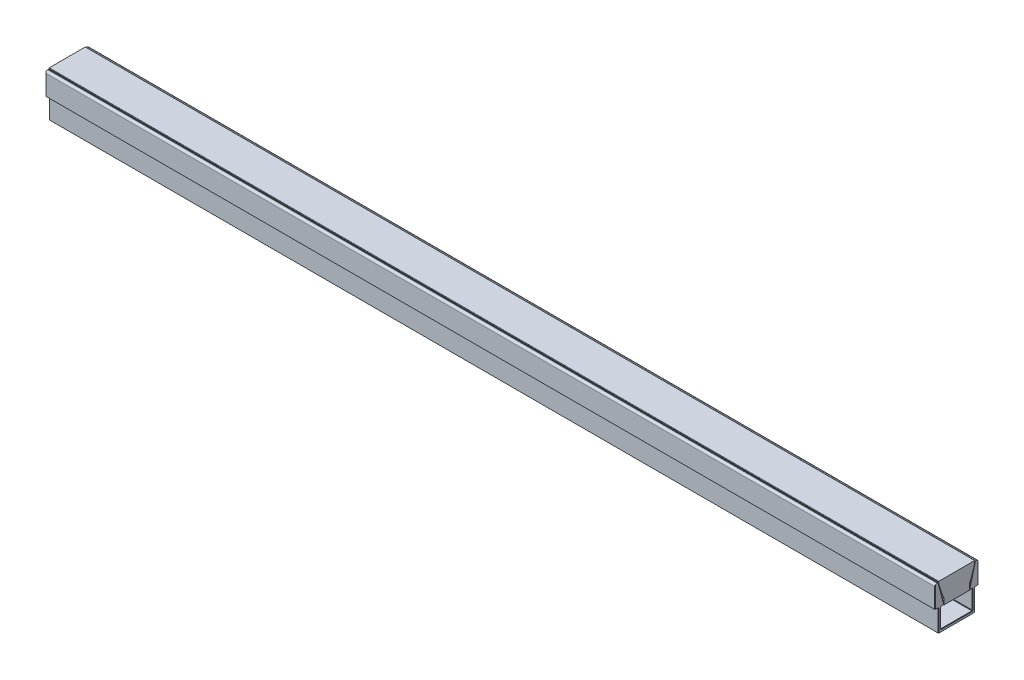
ISO-10303-21;
HEADER;
FILE_DESCRIPTION(('STEP AP214'),'2;1');
FILE_NAME('part.step','',(''),(''),'','','');
FILE_SCHEMA(('AUTOMOTIVE_DESIGN { 1 0 10303 214 1 1 1 1 }'));
ENDSEC;
DATA;
#1=APPLICATION_CONTEXT('core data for automotive mechanical design processes');
#2=APPLICATION_PROTOCOL_DEFINITION('international standard','automotive_design',2000,#1);
#3=PRODUCT_CONTEXT('',#1,'mechanical');
#4=PRODUCT('Part','Part','',(#3));
#5=PRODUCT_RELATED_PRODUCT_CATEGORY('part','',(#4));
#6=PRODUCT_DEFINITION_FORMATION('','',#4);
#7=PRODUCT_DEFINITION_CONTEXT('part definition',#1,'design');
#8=PRODUCT_DEFINITION('design','',#6,#7);
#9=PRODUCT_DEFINITION_SHAPE('','',#8);
#10=(LENGTH_UNIT() NAMED_UNIT(*) SI_UNIT(.MILLI.,.METRE.));
#11=(NAMED_UNIT(*) PLANE_ANGLE_UNIT() SI_UNIT($,.RADIAN.));
#12=(NAMED_UNIT(*) SI_UNIT($,.STERADIAN.) SOLID_ANGLE_UNIT());
#13=UNCERTAINTY_MEASURE_WITH_UNIT(LENGTH_MEASURE(1.E-05),#10,'distance_accuracy_value','');
#14=(GEOMETRIC_REPRESENTATION_CONTEXT(3) GLOBAL_UNCERTAINTY_ASSIGNED_CONTEXT((#13)) GLOBAL_UNIT_ASSIGNED_CONTEXT((#10,
#11,#12)) REPRESENTATION_CONTEXT('',''));
#15=CARTESIAN_POINT('',(0.,0.,0.));
#16=DIRECTION('',(0.,0.,1.));
#17=DIRECTION('',(1.,0.,0.));
#18=AXIS2_PLACEMENT_3D('',#15,#16,#17);
#19=CARTESIAN_POINT('',(254.,25.9,0.));
#20=DIRECTION('',(1.,0.,0.));
#21=DIRECTION('',(0.,0.,-1.));
#22=AXIS2_PLACEMENT_3D('',#19,#20,#21);
#23=PLANE('',#22);
#24=DIRECTION('',(0.,1.,0.));
#25=VECTOR('',#24,1.);
#26=CARTESIAN_POINT('',(254.,12.7,-7.155));
#27=LINE('',#26,#25);
#28=CARTESIAN_POINT('',(254.,12.7,-7.155));
#29=VERTEX_POINT('',#28);
#30=CARTESIAN_POINT('',(254.,15.7,-7.155));
#31=VERTEX_POINT('',#30);
#32=EDGE_CURVE('P0_E94',#29,#31,#27,.T.);
#33=ORIENTED_EDGE('',*,*,#32,.T.);
#34=CARTESIAN_POINT('',(254.,42.8977693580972,56.8634513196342));
#35=DIRECTION('',(1.,0.,0.));
#36=DIRECTION('',(0.,0.,1.));
#37=AXIS2_PLACEMENT_3D('',#34,#35,#36);
#38=CIRCLE('',#37,69.5563136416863);
#39=CARTESIAN_POINT('',(254.,25.4,-10.4560022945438));
#40=VERTEX_POINT('',#39);
#41=EDGE_CURVE('P0_E105',#31,#40,#38,.T.);
#42=ORIENTED_EDGE('',*,*,#41,.T.);
#43=DIRECTION('',(0.,-1.,0.));
#44=VECTOR('',#43,1.);
#45=CARTESIAN_POINT('',(254.,25.9,-10.4560022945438));
#46=LINE('',#45,#44);
#47=CARTESIAN_POINT('',(254.,25.7,-10.4560022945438));
#48=VERTEX_POINT('',#47);
#49=EDGE_CURVE('P0_E128',#48,#40,#46,.T.);
#50=ORIENTED_EDGE('',*,*,#49,.F.);
#51=CARTESIAN_POINT('',(254.,25.7,-10.2560022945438));
#52=DIRECTION('',(1.,0.,0.));
#53=DIRECTION('',(0.,0.,-1.));
#54=AXIS2_PLACEMENT_3D('',#51,#52,#53);
#55=CIRCLE('',#54,0.2);
#56=CARTESIAN_POINT('',(254.,25.9,-10.2560022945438));
#57=VERTEX_POINT('',#56);
#58=EDGE_CURVE('P0_E153',#48,#57,#55,.T.);
#59=ORIENTED_EDGE('',*,*,#58,.T.);
#60=DIRECTION('',(0.,0.,1.));
#61=VECTOR('',#60,1.);
#62=CARTESIAN_POINT('',(254.,25.9,0.));
#63=LINE('',#62,#61);
#64=CARTESIAN_POINT('',(254.,25.9,10.2560022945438));
#65=VERTEX_POINT('',#64);
#66=EDGE_CURVE('P0_E132',#57,#65,#63,.T.);
#67=ORIENTED_EDGE('',*,*,#66,.T.);
#68=CARTESIAN_POINT('',(254.,25.7,10.2560022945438));
#69=DIRECTION('',(1.,0.,0.));
#70=DIRECTION('',(0.,0.,-1.));
#71=AXIS2_PLACEMENT_3D('',#68,#69,#70);
#72=CIRCLE('',#71,0.2);
#73=CARTESIAN_POINT('',(254.,25.7,10.4560022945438));
#74=VERTEX_POINT('',#73);
#75=EDGE_CURVE('P0_E24',#65,#74,#72,.T.);
#76=ORIENTED_EDGE('',*,*,#75,.T.);
#77=DIRECTION('',(0.,-1.,0.));
#78=VECTOR('',#77,1.);
#79=CARTESIAN_POINT('',(254.,25.9,10.4560022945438));
#80=LINE('',#79,#78);
#81=CARTESIAN_POINT('',(254.,25.4,10.4560022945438));
#82=VERTEX_POINT('',#81);
#83=EDGE_CURVE('P0_E116',#74,#82,#80,.T.);
#84=ORIENTED_EDGE('',*,*,#83,.T.);
#85=CARTESIAN_POINT('',(254.,42.8977693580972,-56.8634513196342));
#86=DIRECTION('',(-1.,0.,0.));
#87=DIRECTION('',(0.,0.,-1.));
#88=AXIS2_PLACEMENT_3D('',#85,#86,#87);
#89=CIRCLE('',#88,69.5563136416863);
#90=CARTESIAN_POINT('',(254.,15.7,7.155));
#91=VERTEX_POINT('',#90);
#92=EDGE_CURVE('P0_E182',#91,#82,#89,.T.);
#93=ORIENTED_EDGE('',*,*,#92,.F.);
#94=DIRECTION('',(0.,1.,0.));
#95=VECTOR('',#94,1.);
#96=CARTESIAN_POINT('',(254.,12.7,7.155));
#97=LINE('',#96,#95);
#98=CARTESIAN_POINT('',(254.,12.7,7.155));
#99=VERTEX_POINT('',#98);
#100=EDGE_CURVE('P0_E112',#99,#91,#97,.T.);
#101=ORIENTED_EDGE('',*,*,#100,.F.);
#102=DIRECTION('',(0.,0.,-1.));
#103=VECTOR('',#102,1.);
#104=CARTESIAN_POINT('',(254.,12.7,7.155));
#105=LINE('',#104,#103);
#106=EDGE_CURVE('P0_E109',#99,#29,#105,.T.);
#107=ORIENTED_EDGE('',*,*,#106,.T.);
#108=EDGE_LOOP('',(#33,#42,#50,#59,#67,#76,#84,#93,#101,#107));
#109=FACE_BOUND('',#108,.T.);
#110=ADVANCED_FACE('P0_F16',(#109),#23,.T.);
#111=CARTESIAN_POINT('',(-254.,25.9,0.));
#112=DIRECTION('',(1.,0.,0.));
#113=DIRECTION('',(0.,0.,-1.));
#114=AXIS2_PLACEMENT_3D('',#111,#112,#113);
#115=PLANE('',#114);
#116=CARTESIAN_POINT('',(-254.,42.8977693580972,56.8634513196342));
#117=DIRECTION('',(1.,0.,0.));
#118=DIRECTION('',(0.,0.,-1.));
#119=AXIS2_PLACEMENT_3D('',#116,#117,#118);
#120=CIRCLE('',#119,69.5563136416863);
#121=CARTESIAN_POINT('',(-254.,25.4,-10.4560022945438));
#122=VERTEX_POINT('',#121);
#123=CARTESIAN_POINT('',(-254.,15.7,-7.155));
#124=VERTEX_POINT('',#123);
#125=EDGE_CURVE('P0_E188',#122,#124,#120,.F.);
#126=ORIENTED_EDGE('',*,*,#125,.T.);
#127=DIRECTION('',(0.,-1.,0.));
#128=VECTOR('',#127,1.);
#129=CARTESIAN_POINT('',(-254.,12.7,-7.155));
#130=LINE('',#129,#128);
#131=CARTESIAN_POINT('',(-254.,12.7,-7.155));
#132=VERTEX_POINT('',#131);
#133=EDGE_CURVE('P0_E185',#124,#132,#130,.T.);
#134=ORIENTED_EDGE('',*,*,#133,.T.);
#135=DIRECTION('',(0.,0.,-1.));
#136=VECTOR('',#135,1.);
#137=CARTESIAN_POINT('',(-254.,12.7,7.155));
#138=LINE('',#137,#136);
#139=CARTESIAN_POINT('',(-254.,12.7,7.155));
#140=VERTEX_POINT('',#139);
#141=EDGE_CURVE('P0_E121',#140,#132,#138,.T.);
#142=ORIENTED_EDGE('',*,*,#141,.F.);
#143=DIRECTION('',(0.,-1.,0.));
#144=VECTOR('',#143,1.);
#145=CARTESIAN_POINT('',(-254.,12.7,7.155));
#146=LINE('',#145,#144);
#147=CARTESIAN_POINT('',(-254.,15.7,7.155));
#148=VERTEX_POINT('',#147);
#149=EDGE_CURVE('P0_E177',#148,#140,#146,.T.);
#150=ORIENTED_EDGE('',*,*,#149,.F.);
#151=CARTESIAN_POINT('',(-254.,42.8977693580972,-56.8634513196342));
#152=DIRECTION('',(1.,0.,0.));
#153=DIRECTION('',(0.,0.,-1.));
#154=AXIS2_PLACEMENT_3D('',#151,#152,#153);
#155=CIRCLE('',#154,69.5563136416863);
#156=CARTESIAN_POINT('',(-254.,25.4,10.4560022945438));
#157=VERTEX_POINT('',#156);
#158=EDGE_CURVE('P0_E175',#157,#148,#155,.T.);
#159=ORIENTED_EDGE('',*,*,#158,.F.);
#160=DIRECTION('',(0.,-1.,0.));
#161=VECTOR('',#160,1.);
#162=CARTESIAN_POINT('',(-254.,25.9,10.4560022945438));
#163=LINE('',#162,#161);
#164=CARTESIAN_POINT('',(-254.,25.7,10.4560022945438));
#165=VERTEX_POINT('',#164);
#166=EDGE_CURVE('P0_E125',#165,#157,#163,.T.);
#167=ORIENTED_EDGE('',*,*,#166,.F.);
#168=CARTESIAN_POINT('',(-254.,25.7,10.2560022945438));
#169=DIRECTION('',(1.,0.,0.));
#170=DIRECTION('',(0.,0.,-1.));
#171=AXIS2_PLACEMENT_3D('',#168,#169,#170);
#172=CIRCLE('',#171,0.2);
#173=CARTESIAN_POINT('',(-254.,25.9,10.2560022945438));
#174=VERTEX_POINT('',#173);
#175=EDGE_CURVE('P0_E147',#165,#174,#172,.F.);
#176=ORIENTED_EDGE('',*,*,#175,.T.);
#177=DIRECTION('',(0.,0.,1.));
#178=VECTOR('',#177,1.);
#179=CARTESIAN_POINT('',(-254.,25.9,0.));
#180=LINE('',#179,#178);
#181=CARTESIAN_POINT('',(-254.,25.9,-10.2560022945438));
#182=VERTEX_POINT('',#181);
#183=EDGE_CURVE('P0_E122',#182,#174,#180,.T.);
#184=ORIENTED_EDGE('',*,*,#183,.F.);
#185=CARTESIAN_POINT('',(-254.,25.7,-10.2560022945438));
#186=DIRECTION('',(1.,0.,0.));
#187=DIRECTION('',(0.,0.,-1.));
#188=AXIS2_PLACEMENT_3D('',#185,#186,#187);
#189=CIRCLE('',#188,0.2);
#190=CARTESIAN_POINT('',(-254.,25.7,-10.4560022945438));
#191=VERTEX_POINT('',#190);
#192=EDGE_CURVE('P0_E145',#182,#191,#189,.F.);
#193=ORIENTED_EDGE('',*,*,#192,.T.);
#194=DIRECTION('',(0.,-1.,0.));
#195=VECTOR('',#194,1.);
#196=CARTESIAN_POINT('',(-254.,25.9,-10.4560022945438));
#197=LINE('',#196,#195);
#198=EDGE_CURVE('P0_E173',#191,#122,#197,.T.);
#199=ORIENTED_EDGE('',*,*,#198,.T.);
#200=EDGE_LOOP('',(#126,#134,#142,#150,#159,#167,#176,#184,#193,#199));
#201=FACE_BOUND('',#200,.T.);
#202=ADVANCED_FACE('P0_F166',(#201),#115,.F.);
#203=CARTESIAN_POINT('',(254.,25.9,0.));
#204=DIRECTION('',(0.,-1.,0.));
#205=DIRECTION('',(0.,0.,-1.));
#206=AXIS2_PLACEMENT_3D('',#203,#204,#205);
#207=PLANE('',#206);
#208=ORIENTED_EDGE('',*,*,#183,.T.);
#209=DIRECTION('',(-1.,0.,0.));
#210=VECTOR('',#209,1.);
#211=CARTESIAN_POINT('',(254.,25.9,10.2560022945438));
#212=LINE('',#211,#210);
#213=EDGE_CURVE('P0_E37',#174,#65,#212,.F.);
#214=ORIENTED_EDGE('',*,*,#213,.T.);
#215=ORIENTED_EDGE('',*,*,#66,.F.);
#216=DIRECTION('',(-1.,0.,0.));
#217=VECTOR('',#216,1.);
#218=CARTESIAN_POINT('',(-254.,25.9,-10.2560022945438));
#219=LINE('',#218,#217);
#220=EDGE_CURVE('P0_E149',#57,#182,#219,.T.);
#221=ORIENTED_EDGE('',*,*,#220,.T.);
#222=EDGE_LOOP('',(#208,#214,#215,#221));
#223=FACE_BOUND('',#222,.T.);
#224=ADVANCED_FACE('P0_F168',(#223),#207,.F.);
#225=CARTESIAN_POINT('',(254.,25.9,10.4560022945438));
#226=DIRECTION('',(0.,0.,-1.));
#227=DIRECTION('',(0.,1.,0.));
#228=AXIS2_PLACEMENT_3D('',#225,#226,#227);
#229=PLANE('',#228);
#230=ORIENTED_EDGE('',*,*,#83,.F.);
#231=DIRECTION('',(-1.,0.,0.));
#232=VECTOR('',#231,1.);
#233=CARTESIAN_POINT('',(254.,25.7,10.4560022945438));
#234=LINE('',#233,#232);
#235=EDGE_CURVE('P0_E142',#74,#165,#234,.T.);
#236=ORIENTED_EDGE('',*,*,#235,.T.);
#237=ORIENTED_EDGE('',*,*,#166,.T.);
#238=DIRECTION('',(-1.,0.,0.));
#239=VECTOR('',#238,1.);
#240=CARTESIAN_POINT('',(254.,25.4,10.4560022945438));
#241=LINE('',#240,#239);
#242=EDGE_CURVE('P0_E140',#82,#157,#241,.T.);
#243=ORIENTED_EDGE('',*,*,#242,.F.);
#244=EDGE_LOOP('',(#230,#236,#237,#243));
#245=FACE_BOUND('',#244,.T.);
#246=ADVANCED_FACE('P0_F160',(#245),#229,.F.);
#247=CARTESIAN_POINT('',(254.,12.7,7.155));
#248=DIRECTION('',(0.,1.,0.));
#249=DIRECTION('',(0.,0.,1.));
#250=AXIS2_PLACEMENT_3D('',#247,#248,#249);
#251=PLANE('',#250);
#252=ORIENTED_EDGE('',*,*,#141,.T.);
#253=DIRECTION('',(-1.,0.,0.));
#254=VECTOR('',#253,1.);
#255=CARTESIAN_POINT('',(254.,12.7,-7.155));
#256=LINE('',#255,#254);
#257=EDGE_CURVE('P0_E98',#29,#132,#256,.T.);
#258=ORIENTED_EDGE('',*,*,#257,.F.);
#259=ORIENTED_EDGE('',*,*,#106,.F.);
#260=DIRECTION('',(-1.,0.,0.));
#261=VECTOR('',#260,1.);
#262=CARTESIAN_POINT('',(254.,12.7,7.155));
#263=LINE('',#262,#261);
#264=EDGE_CURVE('P0_E115',#99,#140,#263,.T.);
#265=ORIENTED_EDGE('',*,*,#264,.T.);
#266=EDGE_LOOP('',(#252,#258,#259,#265));
#267=FACE_BOUND('',#266,.T.);
#268=ADVANCED_FACE('P0_F119',(#267),#251,.F.);
#269=CARTESIAN_POINT('',(254.,25.9,-10.4560022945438));
#270=DIRECTION('',(0.,0.,-1.));
#271=DIRECTION('',(0.,1.,0.));
#272=AXIS2_PLACEMENT_3D('',#269,#270,#271);
#273=PLANE('',#272);
#274=ORIENTED_EDGE('',*,*,#198,.F.);
#275=DIRECTION('',(-1.,0.,0.));
#276=VECTOR('',#275,1.);
#277=CARTESIAN_POINT('',(254.,25.7,-10.4560022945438));
#278=LINE('',#277,#276);
#279=EDGE_CURVE('P0_E11',#191,#48,#278,.F.);
#280=ORIENTED_EDGE('',*,*,#279,.T.);
#281=ORIENTED_EDGE('',*,*,#49,.T.);
#282=DIRECTION('',(-1.,0.,0.));
#283=VECTOR('',#282,1.);
#284=CARTESIAN_POINT('',(254.,25.4,-10.4560022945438));
#285=LINE('',#284,#283);
#286=EDGE_CURVE('P0_E123',#40,#122,#285,.T.);
#287=ORIENTED_EDGE('',*,*,#286,.T.);
#288=EDGE_LOOP('',(#274,#280,#281,#287));
#289=FACE_BOUND('',#288,.T.);
#290=ADVANCED_FACE('P0_F174',(#289),#273,.T.);
#291=CARTESIAN_POINT('',(254.,25.7,10.2560022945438));
#292=DIRECTION('',(-1.,0.,0.));
#293=DIRECTION('',(0.,0.,1.));
#294=AXIS2_PLACEMENT_3D('',#291,#292,#293);
#295=CYLINDRICAL_SURFACE('',#294,0.2);
#296=ORIENTED_EDGE('',*,*,#75,.F.);
#297=ORIENTED_EDGE('',*,*,#213,.F.);
#298=ORIENTED_EDGE('',*,*,#175,.F.);
#299=ORIENTED_EDGE('',*,*,#235,.F.);
#300=EDGE_LOOP('',(#296,#297,#298,#299));
#301=FACE_BOUND('',#300,.T.);
#302=ADVANCED_FACE('P0_F162',(#301),#295,.T.);
#303=CARTESIAN_POINT('',(254.,25.7,-10.2560022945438));
#304=DIRECTION('',(1.,0.,0.));
#305=DIRECTION('',(0.,0.,-1.));
#306=AXIS2_PLACEMENT_3D('',#303,#304,#305);
#307=CYLINDRICAL_SURFACE('',#306,0.2);
#308=ORIENTED_EDGE('',*,*,#58,.F.);
#309=ORIENTED_EDGE('',*,*,#279,.F.);
#310=ORIENTED_EDGE('',*,*,#192,.F.);
#311=ORIENTED_EDGE('',*,*,#220,.F.);
#312=EDGE_LOOP('',(#308,#309,#310,#311));
#313=FACE_BOUND('',#312,.T.);
#314=ADVANCED_FACE('P0_F18',(#313),#307,.T.);
#315=CARTESIAN_POINT('',(-267.1219897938,12.7,7.155));
#316=DIRECTION('',(0.,0.,-1.));
#317=DIRECTION('',(0.,1.,0.));
#318=AXIS2_PLACEMENT_3D('',#315,#316,#317);
#319=PLANE('',#318);
#320=ORIENTED_EDGE('',*,*,#149,.T.);
#321=ORIENTED_EDGE('',*,*,#264,.F.);
#322=ORIENTED_EDGE('',*,*,#100,.T.);
#323=DIRECTION('',(1.,0.,0.));
#324=VECTOR('',#323,1.);
#325=CARTESIAN_POINT('',(-267.1219897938,15.7,7.155));
#326=LINE('',#325,#324);
#327=EDGE_CURVE('P0_E180',#148,#91,#326,.T.);
#328=ORIENTED_EDGE('',*,*,#327,.F.);
#329=EDGE_LOOP('',(#320,#321,#322,#328));
#330=FACE_BOUND('',#329,.T.);
#331=ADVANCED_FACE('P0_F202',(#330),#319,.F.);
#332=CARTESIAN_POINT('',(-267.1219897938,42.8977693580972,-56.8634513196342));
#333=DIRECTION('',(1.,0.,0.));
#334=DIRECTION('',(0.,0.,-1.));
#335=AXIS2_PLACEMENT_3D('',#332,#333,#334);
#336=CYLINDRICAL_SURFACE('',#335,69.5563136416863);
#337=ORIENTED_EDGE('',*,*,#158,.T.);
#338=ORIENTED_EDGE('',*,*,#327,.T.);
#339=ORIENTED_EDGE('',*,*,#92,.T.);
#340=ORIENTED_EDGE('',*,*,#242,.T.);
#341=EDGE_LOOP('',(#337,#338,#339,#340));
#342=FACE_BOUND('',#341,.T.);
#343=ADVANCED_FACE('P0_F194',(#342),#336,.T.);
#344=CARTESIAN_POINT('',(-267.1219897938,42.8977693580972,56.8634513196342));
#345=DIRECTION('',(1.,0.,0.));
#346=DIRECTION('',(0.,0.,-1.));
#347=AXIS2_PLACEMENT_3D('',#344,#345,#346);
#348=CYLINDRICAL_SURFACE('',#347,69.5563136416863);
#349=ORIENTED_EDGE('',*,*,#286,.F.);
#350=ORIENTED_EDGE('',*,*,#41,.F.);
#351=DIRECTION('',(1.,0.,0.));
#352=VECTOR('',#351,1.);
#353=CARTESIAN_POINT('',(-267.1219897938,15.7,-7.155));
#354=LINE('',#353,#352);
#355=EDGE_CURVE('P0_E101',#124,#31,#354,.T.);
#356=ORIENTED_EDGE('',*,*,#355,.F.);
#357=ORIENTED_EDGE('',*,*,#125,.F.);
#358=EDGE_LOOP('',(#349,#350,#356,#357));
#359=FACE_BOUND('',#358,.T.);
#360=ADVANCED_FACE('P0_F192',(#359),#348,.T.);
#361=CARTESIAN_POINT('',(-267.1219897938,12.7,-7.155));
#362=DIRECTION('',(0.,0.,-1.));
#363=DIRECTION('',(0.,1.,0.));
#364=AXIS2_PLACEMENT_3D('',#361,#362,#363);
#365=PLANE('',#364);
#366=ORIENTED_EDGE('',*,*,#355,.T.);
#367=ORIENTED_EDGE('',*,*,#32,.F.);
#368=ORIENTED_EDGE('',*,*,#257,.T.);
#369=ORIENTED_EDGE('',*,*,#133,.F.);
#370=EDGE_LOOP('',(#366,#367,#368,#369));
#371=FACE_BOUND('',#370,.T.);
#372=ADVANCED_FACE('P0_F96',(#371),#365,.T.);
#373=CLOSED_SHELL('',(#110,#202,#224,#246,#268,#290,#302,#314,#331,#343,#360,#372));
#374=MANIFOLD_SOLID_BREP('P0_B1',#373);
#375=CARTESIAN_POINT('',(-254.,0.,0.));
#376=DIRECTION('',(-1.,0.,0.));
#377=DIRECTION('',(0.,0.,1.));
#378=AXIS2_PLACEMENT_3D('',#375,#376,#377);
#379=PLANE('',#378);
#380=DIRECTION('',(0.,0.,-1.));
#381=VECTOR('',#380,1.);
#382=CARTESIAN_POINT('',(-254.,25.4,-12.4));
#383=LINE('',#382,#381);
#384=CARTESIAN_POINT('',(-254.,25.4,-11.250701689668));
#385=VERTEX_POINT('',#384);
#386=CARTESIAN_POINT('',(-254.,25.4,-11.3));
#387=VERTEX_POINT('',#386);
#388=EDGE_CURVE('P1_E720',#385,#387,#383,.T.);
#389=ORIENTED_EDGE('',*,*,#388,.T.);
#390=CARTESIAN_POINT('',(-254.,24.3,-11.3));
#391=DIRECTION('',(-1.,0.,0.));
#392=DIRECTION('',(0.,0.,1.));
#393=AXIS2_PLACEMENT_3D('',#390,#391,#392);
#394=CIRCLE('',#393,1.1);
#395=CARTESIAN_POINT('',(-254.,24.9982120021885,-12.15));
#396=VERTEX_POINT('',#395);
#397=EDGE_CURVE('P1_E829',#387,#396,#394,.T.);
#398=ORIENTED_EDGE('',*,*,#397,.T.);
#399=DIRECTION('',(0.,-1.,0.));
#400=VECTOR('',#399,1.);
#401=CARTESIAN_POINT('',(-254.,0.,-12.15));
#402=LINE('',#401,#400);
#403=CARTESIAN_POINT('',(-254.,12.95,-12.15));
#404=VERTEX_POINT('',#403);
#405=EDGE_CURVE('P1_E496',#396,#404,#402,.T.);
#406=ORIENTED_EDGE('',*,*,#405,.T.);
#407=DIRECTION('',(0.,0.,1.));
#408=VECTOR('',#407,1.);
#409=CARTESIAN_POINT('',(-254.,12.95,0.));
#410=LINE('',#409,#408);
#411=CARTESIAN_POINT('',(-254.,12.95,-10.65));
#412=VERTEX_POINT('',#411);
#413=EDGE_CURVE('P1_E494',#404,#412,#410,.T.);
#414=ORIENTED_EDGE('',*,*,#413,.T.);
#415=DIRECTION('',(0.,0.707106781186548,-0.707106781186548));
#416=VECTOR('',#415,1.);
#417=CARTESIAN_POINT('',(-254.,1.15,1.15));
#418=LINE('',#417,#416);
#419=CARTESIAN_POINT('',(-254.,12.7,-10.4));
#420=VERTEX_POINT('',#419);
#421=EDGE_CURVE('P1_E491',#420,#412,#418,.T.);
#422=ORIENTED_EDGE('',*,*,#421,.F.);
#423=DIRECTION('',(0.,0.707106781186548,-0.707106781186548));
#424=VECTOR('',#423,1.);
#425=CARTESIAN_POINT('',(-254.,1.15,1.15));
#426=LINE('',#425,#424);
#427=CARTESIAN_POINT('',(-254.,12.45,-10.15));
#428=VERTEX_POINT('',#427);
#429=EDGE_CURVE('P1_E488',#428,#420,#426,.T.);
#430=ORIENTED_EDGE('',*,*,#429,.F.);
#431=DIRECTION('',(0.,-1.,0.));
#432=VECTOR('',#431,1.);
#433=CARTESIAN_POINT('',(-254.,0.,-10.15));
#434=LINE('',#433,#432);
#435=CARTESIAN_POINT('',(-254.,0.250000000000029,-10.15));
#436=VERTEX_POINT('',#435);
#437=EDGE_CURVE('P1_E486',#428,#436,#434,.T.);
#438=ORIENTED_EDGE('',*,*,#437,.T.);
#439=DIRECTION('',(0.,0.,1.));
#440=VECTOR('',#439,1.);
#441=CARTESIAN_POINT('',(-254.,0.250000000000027,10.4));
#442=LINE('',#441,#440);
#443=CARTESIAN_POINT('',(-254.,0.250000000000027,10.15));
#444=VERTEX_POINT('',#443);
#445=EDGE_CURVE('P1_E484',#436,#444,#442,.T.);
#446=ORIENTED_EDGE('',*,*,#445,.T.);
#447=DIRECTION('',(0.,1.,0.));
#448=VECTOR('',#447,1.);
#449=CARTESIAN_POINT('',(-254.,12.7,10.15));
#450=LINE('',#449,#448);
#451=CARTESIAN_POINT('',(-254.,12.45,10.15));
#452=VERTEX_POINT('',#451);
#453=EDGE_CURVE('P1_E482',#444,#452,#450,.T.);
#454=ORIENTED_EDGE('',*,*,#453,.T.);
#455=DIRECTION('',(0.,-0.707106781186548,-0.707106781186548));
#456=VECTOR('',#455,1.);
#457=CARTESIAN_POINT('',(-254.,1.15,-1.15));
#458=LINE('',#457,#456);
#459=CARTESIAN_POINT('',(-254.,12.7,10.4));
#460=VERTEX_POINT('',#459);
#461=EDGE_CURVE('P1_E479',#460,#452,#458,.T.);
#462=ORIENTED_EDGE('',*,*,#461,.F.);
#463=DIRECTION('',(0.,-0.707106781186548,-0.707106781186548));
#464=VECTOR('',#463,1.);
#465=CARTESIAN_POINT('',(-254.,1.15,-1.15));
#466=LINE('',#465,#464);
#467=CARTESIAN_POINT('',(-254.,12.95,10.65));
#468=VERTEX_POINT('',#467);
#469=EDGE_CURVE('P1_E476',#468,#460,#466,.T.);
#470=ORIENTED_EDGE('',*,*,#469,.F.);
#471=DIRECTION('',(0.,0.,1.));
#472=VECTOR('',#471,1.);
#473=CARTESIAN_POINT('',(-254.,12.95,12.4));
#474=LINE('',#473,#472);
#475=CARTESIAN_POINT('',(-254.,12.95,12.15));
#476=VERTEX_POINT('',#475);
#477=EDGE_CURVE('P1_E474',#468,#476,#474,.T.);
#478=ORIENTED_EDGE('',*,*,#477,.T.);
#479=DIRECTION('',(0.,1.,0.));
#480=VECTOR('',#479,1.);
#481=CARTESIAN_POINT('',(-254.,25.4,12.15));
#482=LINE('',#481,#480);
#483=CARTESIAN_POINT('',(-254.,24.9982120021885,12.15));
#484=VERTEX_POINT('',#483);
#485=EDGE_CURVE('P1_E471',#476,#484,#482,.T.);
#486=ORIENTED_EDGE('',*,*,#485,.T.);
#487=CARTESIAN_POINT('',(-254.,24.3,11.3));
#488=DIRECTION('',(-1.,0.,0.));
#489=DIRECTION('',(0.,0.,1.));
#490=AXIS2_PLACEMENT_3D('',#487,#488,#489);
#491=CIRCLE('',#490,1.1);
#492=CARTESIAN_POINT('',(-254.,25.4,11.3));
#493=VERTEX_POINT('',#492);
#494=EDGE_CURVE('P1_E825',#484,#493,#491,.T.);
#495=ORIENTED_EDGE('',*,*,#494,.T.);
#496=DIRECTION('',(0.,0.,1.));
#497=VECTOR('',#496,1.);
#498=CARTESIAN_POINT('',(-254.,25.4,12.4));
#499=LINE('',#498,#497);
#500=CARTESIAN_POINT('',(-254.,25.4,11.250701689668));
#501=VERTEX_POINT('',#500);
#502=EDGE_CURVE('P1_E1033',#501,#493,#499,.T.);
#503=ORIENTED_EDGE('',*,*,#502,.F.);
#504=CARTESIAN_POINT('',(-254.,24.3,11.250701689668));
#505=DIRECTION('',(-1.,0.,0.));
#506=DIRECTION('',(0.,0.,1.));
#507=AXIS2_PLACEMENT_3D('',#504,#505,#506);
#508=CIRCLE('',#507,1.1);
#509=CARTESIAN_POINT('',(-254.,25.1895386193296,10.6036151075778));
#510=VERTEX_POINT('',#509);
#511=EDGE_CURVE('P1_E823',#501,#510,#508,.T.);
#512=ORIENTED_EDGE('',*,*,#511,.T.);
#513=DIRECTION('',(0.,-0.967859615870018,-0.25149108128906));
#514=VECTOR('',#513,1.);
#515=CARTESIAN_POINT('',(-254.,12.6371272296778,7.34196490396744));
#516=LINE('',#515,#514);
#517=CARTESIAN_POINT('',(-254.,12.9499999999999,7.4232625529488));
#518=VERTEX_POINT('',#517);
#519=EDGE_CURVE('P1_E498',#510,#518,#516,.T.);
#520=ORIENTED_EDGE('',*,*,#519,.T.);
#521=DIRECTION('',(0.,0.,1.));
#522=VECTOR('',#521,1.);
#523=CARTESIAN_POINT('',(-254.,12.9499999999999,9.1));
#524=LINE('',#523,#522);
#525=CARTESIAN_POINT('',(-254.,12.9499999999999,8.85000000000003));
#526=VERTEX_POINT('',#525);
#527=EDGE_CURVE('P1_E500',#518,#526,#524,.T.);
#528=ORIENTED_EDGE('',*,*,#527,.T.);
#529=DIRECTION('',(0.,0.707106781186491,-0.707106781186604));
#530=VECTOR('',#529,1.);
#531=CARTESIAN_POINT('',(-254.,10.900000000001,10.8999999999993));
#532=LINE('',#531,#530);
#533=CARTESIAN_POINT('',(-254.,12.7,9.1));
#534=VERTEX_POINT('',#533);
#535=EDGE_CURVE('P1_E502',#534,#526,#532,.T.);
#536=ORIENTED_EDGE('',*,*,#535,.F.);
#537=DIRECTION('',(0.,0.707106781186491,-0.707106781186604));
#538=VECTOR('',#537,1.);
#539=CARTESIAN_POINT('',(-254.,10.900000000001,10.8999999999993));
#540=LINE('',#539,#538);
#541=CARTESIAN_POINT('',(-254.,12.4500000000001,9.34999999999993));
#542=VERTEX_POINT('',#541);
#543=EDGE_CURVE('P1_E505',#542,#534,#540,.T.);
#544=ORIENTED_EDGE('',*,*,#543,.F.);
#545=DIRECTION('',(0.,-1.,0.));
#546=VECTOR('',#545,1.);
#547=CARTESIAN_POINT('',(-254.,1.6,9.34999999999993));
#548=LINE('',#547,#546);
#549=CARTESIAN_POINT('',(-254.,1.84999999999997,9.34999999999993));
#550=VERTEX_POINT('',#549);
#551=EDGE_CURVE('P1_E508',#542,#550,#548,.T.);
#552=ORIENTED_EDGE('',*,*,#551,.T.);
#553=DIRECTION('',(0.,0.707106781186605,0.70710678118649));
#554=VECTOR('',#553,1.);
#555=CARTESIAN_POINT('',(-254.,-3.75000000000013,3.75000000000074));
#556=LINE('',#555,#554);
#557=CARTESIAN_POINT('',(-254.,1.6,9.1));
#558=VERTEX_POINT('',#557);
#559=EDGE_CURVE('P1_E510',#558,#550,#556,.T.);
#560=ORIENTED_EDGE('',*,*,#559,.F.);
#561=DIRECTION('',(0.,0.707106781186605,0.70710678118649));
#562=VECTOR('',#561,1.);
#563=CARTESIAN_POINT('',(-254.,-3.75000000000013,3.75000000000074));
#564=LINE('',#563,#562);
#565=CARTESIAN_POINT('',(-254.,1.35000000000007,8.85000000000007));
#566=VERTEX_POINT('',#565);
#567=EDGE_CURVE('P1_E513',#566,#558,#564,.T.);
#568=ORIENTED_EDGE('',*,*,#567,.F.);
#569=DIRECTION('',(0.,0.,-1.));
#570=VECTOR('',#569,1.);
#571=CARTESIAN_POINT('',(-254.,1.35000000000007,-9.1));
#572=LINE('',#571,#570);
#573=CARTESIAN_POINT('',(-254.,1.35000000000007,-8.85000000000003));
#574=VERTEX_POINT('',#573);
#575=EDGE_CURVE('P1_E516',#566,#574,#572,.T.);
#576=ORIENTED_EDGE('',*,*,#575,.T.);
#577=DIRECTION('',(0.,-0.707106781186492,0.707106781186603));
#578=VECTOR('',#577,1.);
#579=CARTESIAN_POINT('',(-254.,-3.74999999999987,-3.74999999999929));
#580=LINE('',#579,#578);
#581=CARTESIAN_POINT('',(-254.,1.6,-9.1));
#582=VERTEX_POINT('',#581);
#583=EDGE_CURVE('P1_E518',#582,#574,#580,.T.);
#584=ORIENTED_EDGE('',*,*,#583,.F.);
#585=DIRECTION('',(0.,-0.707106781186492,0.707106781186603));
#586=VECTOR('',#585,1.);
#587=CARTESIAN_POINT('',(-254.,-3.74999999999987,-3.74999999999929));
#588=LINE('',#587,#586);
#589=CARTESIAN_POINT('',(-254.,1.84999999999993,-9.34999999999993));
#590=VERTEX_POINT('',#589);
#591=EDGE_CURVE('P1_E521',#590,#582,#588,.T.);
#592=ORIENTED_EDGE('',*,*,#591,.F.);
#593=DIRECTION('',(0.,1.,0.));
#594=VECTOR('',#593,1.);
#595=CARTESIAN_POINT('',(-254.,0.,-9.34999999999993));
#596=LINE('',#595,#594);
#597=CARTESIAN_POINT('',(-254.,12.45,-9.34999999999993));
#598=VERTEX_POINT('',#597);
#599=EDGE_CURVE('P1_E524',#590,#598,#596,.T.);
#600=ORIENTED_EDGE('',*,*,#599,.T.);
#601=DIRECTION('',(0.,-0.707106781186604,-0.707106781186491));
#602=VECTOR('',#601,1.);
#603=CARTESIAN_POINT('',(-254.,10.899999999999,-10.9000000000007));
#604=LINE('',#603,#602);
#605=CARTESIAN_POINT('',(-254.,12.7,-9.1));
#606=VERTEX_POINT('',#605);
#607=EDGE_CURVE('P1_E526',#606,#598,#604,.T.);
#608=ORIENTED_EDGE('',*,*,#607,.F.);
#609=DIRECTION('',(0.,-0.707106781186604,-0.707106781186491));
#610=VECTOR('',#609,1.);
#611=CARTESIAN_POINT('',(-254.,10.899999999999,-10.9000000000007));
#612=LINE('',#611,#610);
#613=CARTESIAN_POINT('',(-254.,12.9499999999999,-8.85000000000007));
#614=VERTEX_POINT('',#613);
#615=EDGE_CURVE('P1_E529',#614,#606,#612,.T.);
#616=ORIENTED_EDGE('',*,*,#615,.F.);
#617=DIRECTION('',(0.,0.,1.));
#618=VECTOR('',#617,1.);
#619=CARTESIAN_POINT('',(-254.,12.9499999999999,0.));
#620=LINE('',#619,#618);
#621=CARTESIAN_POINT('',(-254.,12.9499999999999,-7.42326255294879));
#622=VERTEX_POINT('',#621);
#623=EDGE_CURVE('P1_E532',#614,#622,#620,.T.);
#624=ORIENTED_EDGE('',*,*,#623,.T.);
#625=DIRECTION('',(0.,0.967859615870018,-0.25149108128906));
#626=VECTOR('',#625,1.);
#627=CARTESIAN_POINT('',(-254.,-0.987823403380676,-3.80162340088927));
#628=LINE('',#627,#626);
#629=CARTESIAN_POINT('',(-254.,25.1895386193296,-10.6036151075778));
#630=VERTEX_POINT('',#629);
#631=EDGE_CURVE('P1_E534',#622,#630,#628,.T.);
#632=ORIENTED_EDGE('',*,*,#631,.T.);
#633=CARTESIAN_POINT('',(-254.,24.3,-11.250701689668));
#634=DIRECTION('',(-1.,0.,0.));
#635=DIRECTION('',(0.,0.,1.));
#636=AXIS2_PLACEMENT_3D('',#633,#634,#635);
#637=CIRCLE('',#636,1.1);
#638=EDGE_CURVE('P1_E827',#630,#385,#637,.T.);
#639=ORIENTED_EDGE('',*,*,#638,.T.);
#640=EDGE_LOOP('',(#389,#398,#406,#414,#422,#430,#438,#446,#454,#462,#470,#478,#486,#495,#503,
#512,#520,#528,#536,#544,#552,#560,#568,#576,#584,#592,#600,#608,#616,#624,#632,#639));
#641=FACE_BOUND('',#640,.T.);
#642=ADVANCED_FACE('P1_F15',(#641),#379,.T.);
#643=CARTESIAN_POINT('',(254.,0.,0.));
#644=DIRECTION('',(-1.,0.,0.));
#645=DIRECTION('',(0.,0.,1.));
#646=AXIS2_PLACEMENT_3D('',#643,#644,#645);
#647=PLANE('',#646);
#648=DIRECTION('',(0.,1.,0.));
#649=VECTOR('',#648,1.);
#650=CARTESIAN_POINT('',(254.,25.4,-12.15));
#651=LINE('',#650,#649);
#652=CARTESIAN_POINT('',(254.,12.95,-12.15));
#653=VERTEX_POINT('',#652);
#654=CARTESIAN_POINT('',(254.,24.9982120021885,-12.15));
#655=VERTEX_POINT('',#654);
#656=EDGE_CURVE('P1_E409',#653,#655,#651,.T.);
#657=ORIENTED_EDGE('',*,*,#656,.T.);
#658=CARTESIAN_POINT('',(254.,24.3,-11.3));
#659=DIRECTION('',(-1.,0.,0.));
#660=DIRECTION('',(0.,0.,1.));
#661=AXIS2_PLACEMENT_3D('',#658,#659,#660);
#662=CIRCLE('',#661,1.1);
#663=CARTESIAN_POINT('',(254.,25.4,-11.3));
#664=VERTEX_POINT('',#663);
#665=EDGE_CURVE('P1_E843',#655,#664,#662,.F.);
#666=ORIENTED_EDGE('',*,*,#665,.T.);
#667=DIRECTION('',(0.,0.,-1.));
#668=VECTOR('',#667,1.);
#669=CARTESIAN_POINT('',(254.,25.4,-12.4));
#670=LINE('',#669,#668);
#671=CARTESIAN_POINT('',(254.,25.4,-11.250701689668));
#672=VERTEX_POINT('',#671);
#673=EDGE_CURVE('P1_E1027',#672,#664,#670,.T.);
#674=ORIENTED_EDGE('',*,*,#673,.F.);
#675=CARTESIAN_POINT('',(254.,24.3,-11.250701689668));
#676=DIRECTION('',(-1.,0.,0.));
#677=DIRECTION('',(0.,0.,1.));
#678=AXIS2_PLACEMENT_3D('',#675,#676,#677);
#679=CIRCLE('',#678,1.1);
#680=CARTESIAN_POINT('',(254.,25.1895386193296,-10.6036151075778));
#681=VERTEX_POINT('',#680);
#682=EDGE_CURVE('P1_E841',#672,#681,#679,.F.);
#683=ORIENTED_EDGE('',*,*,#682,.T.);
#684=DIRECTION('',(0.,-0.967859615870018,0.25149108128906));
#685=VECTOR('',#684,1.);
#686=CARTESIAN_POINT('',(254.,12.6371272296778,-7.34196490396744));
#687=LINE('',#686,#685);
#688=CARTESIAN_POINT('',(254.,12.95,-7.42326255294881));
#689=VERTEX_POINT('',#688);
#690=EDGE_CURVE('P1_E440',#681,#689,#687,.T.);
#691=ORIENTED_EDGE('',*,*,#690,.T.);
#692=DIRECTION('',(0.,0.,-1.));
#693=VECTOR('',#692,1.);
#694=CARTESIAN_POINT('',(254.,12.95,-9.1));
#695=LINE('',#694,#693);
#696=CARTESIAN_POINT('',(254.,12.95,-8.85000000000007));
#697=VERTEX_POINT('',#696);
#698=EDGE_CURVE('P1_E436',#689,#697,#695,.T.);
#699=ORIENTED_EDGE('',*,*,#698,.T.);
#700=DIRECTION('',(0.,0.707106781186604,0.707106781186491));
#701=VECTOR('',#700,1.);
#702=CARTESIAN_POINT('',(254.,12.95,-8.85000000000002));
#703=LINE('',#702,#701);
#704=CARTESIAN_POINT('',(254.,12.7,-9.1));
#705=VERTEX_POINT('',#704);
#706=EDGE_CURVE('P1_E433',#705,#697,#703,.T.);
#707=ORIENTED_EDGE('',*,*,#706,.F.);
#708=DIRECTION('',(0.,0.707106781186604,0.707106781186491));
#709=VECTOR('',#708,1.);
#710=CARTESIAN_POINT('',(254.,12.95,-8.85000000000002));
#711=LINE('',#710,#709);
#712=CARTESIAN_POINT('',(254.,12.45,-9.34999999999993));
#713=VERTEX_POINT('',#712);
#714=EDGE_CURVE('P1_E424',#713,#705,#711,.T.);
#715=ORIENTED_EDGE('',*,*,#714,.F.);
#716=DIRECTION('',(0.,-1.,0.));
#717=VECTOR('',#716,1.);
#718=CARTESIAN_POINT('',(254.,1.6,-9.34999999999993));
#719=LINE('',#718,#717);
#720=CARTESIAN_POINT('',(254.,1.84999999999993,-9.34999999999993));
#721=VERTEX_POINT('',#720);
#722=EDGE_CURVE('P1_E420',#713,#721,#719,.T.);
#723=ORIENTED_EDGE('',*,*,#722,.T.);
#724=DIRECTION('',(0.,0.707106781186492,-0.707106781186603));
#725=VECTOR('',#724,1.);
#726=CARTESIAN_POINT('',(254.,1.84999999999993,-9.34999999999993));
#727=LINE('',#726,#725);
#728=CARTESIAN_POINT('',(254.,1.6,-9.1));
#729=VERTEX_POINT('',#728);
#730=EDGE_CURVE('P1_E414',#729,#721,#727,.T.);
#731=ORIENTED_EDGE('',*,*,#730,.F.);
#732=DIRECTION('',(0.,0.707106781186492,-0.707106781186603));
#733=VECTOR('',#732,1.);
#734=CARTESIAN_POINT('',(254.,1.84999999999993,-9.34999999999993));
#735=LINE('',#734,#733);
#736=CARTESIAN_POINT('',(254.,1.35000000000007,-8.85000000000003));
#737=VERTEX_POINT('',#736);
#738=EDGE_CURVE('P1_E417',#737,#729,#735,.T.);
#739=ORIENTED_EDGE('',*,*,#738,.F.);
#740=DIRECTION('',(0.,0.,1.));
#741=VECTOR('',#740,1.);
#742=CARTESIAN_POINT('',(254.,1.35000000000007,0.));
#743=LINE('',#742,#741);
#744=CARTESIAN_POINT('',(254.,1.35000000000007,8.85000000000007));
#745=VERTEX_POINT('',#744);
#746=EDGE_CURVE('P1_E422',#737,#745,#743,.T.);
#747=ORIENTED_EDGE('',*,*,#746,.T.);
#748=DIRECTION('',(0.,-0.707106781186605,-0.70710678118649));
#749=VECTOR('',#748,1.);
#750=CARTESIAN_POINT('',(254.,1.35000000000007,8.85000000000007));
#751=LINE('',#750,#749);
#752=CARTESIAN_POINT('',(254.,1.6,9.1));
#753=VERTEX_POINT('',#752);
#754=EDGE_CURVE('P1_E427',#753,#745,#751,.T.);
#755=ORIENTED_EDGE('',*,*,#754,.F.);
#756=DIRECTION('',(0.,-0.707106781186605,-0.70710678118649));
#757=VECTOR('',#756,1.);
#758=CARTESIAN_POINT('',(254.,1.35000000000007,8.85000000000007));
#759=LINE('',#758,#757);
#760=CARTESIAN_POINT('',(254.,1.84999999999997,9.34999999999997));
#761=VERTEX_POINT('',#760);
#762=EDGE_CURVE('P1_E430',#761,#753,#759,.T.);
#763=ORIENTED_EDGE('',*,*,#762,.F.);
#764=DIRECTION('',(0.,1.,0.));
#765=VECTOR('',#764,1.);
#766=CARTESIAN_POINT('',(254.,0.,9.34999999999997));
#767=LINE('',#766,#765);
#768=CARTESIAN_POINT('',(254.,12.4500000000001,9.34999999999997));
#769=VERTEX_POINT('',#768);
#770=EDGE_CURVE('P1_E438',#761,#769,#767,.T.);
#771=ORIENTED_EDGE('',*,*,#770,.T.);
#772=DIRECTION('',(0.,-0.707106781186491,0.707106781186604));
#773=VECTOR('',#772,1.);
#774=CARTESIAN_POINT('',(254.,12.4500000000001,9.34999999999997));
#775=LINE('',#774,#773);
#776=CARTESIAN_POINT('',(254.,12.7,9.1));
#777=VERTEX_POINT('',#776);
#778=EDGE_CURVE('P1_E442',#777,#769,#775,.T.);
#779=ORIENTED_EDGE('',*,*,#778,.F.);
#780=DIRECTION('',(0.,-0.707106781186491,0.707106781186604));
#781=VECTOR('',#780,1.);
#782=CARTESIAN_POINT('',(254.,12.4500000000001,9.34999999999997));
#783=LINE('',#782,#781);
#784=CARTESIAN_POINT('',(254.,12.95,8.85000000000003));
#785=VERTEX_POINT('',#784);
#786=EDGE_CURVE('P1_E445',#785,#777,#783,.T.);
#787=ORIENTED_EDGE('',*,*,#786,.F.);
#788=DIRECTION('',(0.,0.,-1.));
#789=VECTOR('',#788,1.);
#790=CARTESIAN_POINT('',(254.,12.95,0.));
#791=LINE('',#790,#789);
#792=CARTESIAN_POINT('',(254.,12.95,7.42326255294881));
#793=VERTEX_POINT('',#792);
#794=EDGE_CURVE('P1_E448',#785,#793,#791,.T.);
#795=ORIENTED_EDGE('',*,*,#794,.T.);
#796=DIRECTION('',(0.,0.967859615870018,0.25149108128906));
#797=VECTOR('',#796,1.);
#798=CARTESIAN_POINT('',(254.,-0.987823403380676,3.80162340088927));
#799=LINE('',#798,#797);
#800=CARTESIAN_POINT('',(254.,25.1895386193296,10.6036151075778));
#801=VERTEX_POINT('',#800);
#802=EDGE_CURVE('P1_E450',#793,#801,#799,.T.);
#803=ORIENTED_EDGE('',*,*,#802,.T.);
#804=CARTESIAN_POINT('',(254.,24.3,11.250701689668));
#805=DIRECTION('',(-1.,0.,0.));
#806=DIRECTION('',(0.,0.,1.));
#807=AXIS2_PLACEMENT_3D('',#804,#805,#806);
#808=CIRCLE('',#807,1.1);
#809=CARTESIAN_POINT('',(254.,25.4,11.250701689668));
#810=VERTEX_POINT('',#809);
#811=EDGE_CURVE('P1_E837',#801,#810,#808,.F.);
#812=ORIENTED_EDGE('',*,*,#811,.T.);
#813=DIRECTION('',(0.,0.,1.));
#814=VECTOR('',#813,1.);
#815=CARTESIAN_POINT('',(254.,25.4,12.4));
#816=LINE('',#815,#814);
#817=CARTESIAN_POINT('',(254.,25.4,11.3));
#818=VERTEX_POINT('',#817);
#819=EDGE_CURVE('P1_E1035',#810,#818,#816,.T.);
#820=ORIENTED_EDGE('',*,*,#819,.T.);
#821=CARTESIAN_POINT('',(254.,24.3,11.3));
#822=DIRECTION('',(-1.,0.,0.));
#823=DIRECTION('',(0.,0.,1.));
#824=AXIS2_PLACEMENT_3D('',#821,#822,#823);
#825=CIRCLE('',#824,1.1);
#826=CARTESIAN_POINT('',(254.,24.9982120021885,12.15));
#827=VERTEX_POINT('',#826);
#828=EDGE_CURVE('P1_E839',#818,#827,#825,.F.);
#829=ORIENTED_EDGE('',*,*,#828,.T.);
#830=DIRECTION('',(0.,-1.,0.));
#831=VECTOR('',#830,1.);
#832=CARTESIAN_POINT('',(254.,0.,12.15));
#833=LINE('',#832,#831);
#834=CARTESIAN_POINT('',(254.,12.95,12.15));
#835=VERTEX_POINT('',#834);
#836=EDGE_CURVE('P1_E871',#827,#835,#833,.T.);
#837=ORIENTED_EDGE('',*,*,#836,.T.);
#838=DIRECTION('',(0.,0.,-1.));
#839=VECTOR('',#838,1.);
#840=CARTESIAN_POINT('',(254.,12.95,0.));
#841=LINE('',#840,#839);
#842=CARTESIAN_POINT('',(254.,12.95,10.65));
#843=VERTEX_POINT('',#842);
#844=EDGE_CURVE('P1_E920',#835,#843,#841,.T.);
#845=ORIENTED_EDGE('',*,*,#844,.T.);
#846=DIRECTION('',(0.,0.707106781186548,0.707106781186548));
#847=VECTOR('',#846,1.);
#848=CARTESIAN_POINT('',(254.,12.95,10.65));
#849=LINE('',#848,#847);
#850=CARTESIAN_POINT('',(254.,12.7,10.4));
#851=VERTEX_POINT('',#850);
#852=EDGE_CURVE('P1_E924',#851,#843,#849,.T.);
#853=ORIENTED_EDGE('',*,*,#852,.F.);
#854=DIRECTION('',(0.,0.707106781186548,0.707106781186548));
#855=VECTOR('',#854,1.);
#856=CARTESIAN_POINT('',(254.,12.95,10.65));
#857=LINE('',#856,#855);
#858=CARTESIAN_POINT('',(254.,12.45,10.15));
#859=VERTEX_POINT('',#858);
#860=EDGE_CURVE('P1_E926',#859,#851,#857,.T.);
#861=ORIENTED_EDGE('',*,*,#860,.F.);
#862=DIRECTION('',(0.,-1.,0.));
#863=VECTOR('',#862,1.);
#864=CARTESIAN_POINT('',(254.,0.,10.15));
#865=LINE('',#864,#863);
#866=CARTESIAN_POINT('',(254.,0.250000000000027,10.15));
#867=VERTEX_POINT('',#866);
#868=EDGE_CURVE('P1_E934',#859,#867,#865,.T.);
#869=ORIENTED_EDGE('',*,*,#868,.T.);
#870=DIRECTION('',(0.,0.,-1.));
#871=VECTOR('',#870,1.);
#872=CARTESIAN_POINT('',(254.,0.250000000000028,0.));
#873=LINE('',#872,#871);
#874=CARTESIAN_POINT('',(254.,0.250000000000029,-10.15));
#875=VERTEX_POINT('',#874);
#876=EDGE_CURVE('P1_E936',#867,#875,#873,.T.);
#877=ORIENTED_EDGE('',*,*,#876,.T.);
#878=DIRECTION('',(0.,1.,0.));
#879=VECTOR('',#878,1.);
#880=CARTESIAN_POINT('',(254.,12.7,-10.15));
#881=LINE('',#880,#879);
#882=CARTESIAN_POINT('',(254.,12.45,-10.15));
#883=VERTEX_POINT('',#882);
#884=EDGE_CURVE('P1_E398',#875,#883,#881,.T.);
#885=ORIENTED_EDGE('',*,*,#884,.T.);
#886=DIRECTION('',(0.,-0.707106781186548,0.707106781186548));
#887=VECTOR('',#886,1.);
#888=CARTESIAN_POINT('',(254.,12.45,-10.15));
#889=LINE('',#888,#887);
#890=CARTESIAN_POINT('',(254.,12.7,-10.4));
#891=VERTEX_POINT('',#890);
#892=EDGE_CURVE('P1_E391',#891,#883,#889,.T.);
#893=ORIENTED_EDGE('',*,*,#892,.F.);
#894=DIRECTION('',(0.,-0.707106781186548,0.707106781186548));
#895=VECTOR('',#894,1.);
#896=CARTESIAN_POINT('',(254.,12.45,-10.15));
#897=LINE('',#896,#895);
#898=CARTESIAN_POINT('',(254.,12.95,-10.65));
#899=VERTEX_POINT('',#898);
#900=EDGE_CURVE('P1_E395',#899,#891,#897,.T.);
#901=ORIENTED_EDGE('',*,*,#900,.F.);
#902=DIRECTION('',(0.,0.,-1.));
#903=VECTOR('',#902,1.);
#904=CARTESIAN_POINT('',(254.,12.95,-12.4));
#905=LINE('',#904,#903);
#906=EDGE_CURVE('P1_E407',#899,#653,#905,.T.);
#907=ORIENTED_EDGE('',*,*,#906,.T.);
#908=EDGE_LOOP('',(#657,#666,#674,#683,#691,#699,#707,#715,#723,#731,#739,#747,#755,#763,#771,
#779,#787,#795,#803,#812,#820,#829,#837,#845,#853,#861,#869,#877,#885,#893,#901,#907));
#909=FACE_BOUND('',#908,.T.);
#910=ADVANCED_FACE('P1_F394',(#909),#647,.F.);
#911=CARTESIAN_POINT('',(254.,1.6,9.1));
#912=DIRECTION('',(0.,-1.,0.));
#913=DIRECTION('',(0.,0.,-1.));
#914=AXIS2_PLACEMENT_3D('',#911,#912,#913);
#915=PLANE('',#914);
#916=DIRECTION('',(1.,0.,0.));
#917=VECTOR('',#916,1.);
#918=CARTESIAN_POINT('',(254.,1.6,8.85000000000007));
#919=LINE('',#918,#917);
#920=CARTESIAN_POINT('',(-253.75,1.6,8.85000000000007));
#921=VERTEX_POINT('',#920);
#922=CARTESIAN_POINT('',(253.75,1.6,8.85000000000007));
#923=VERTEX_POINT('',#922);
#924=EDGE_CURVE('P1_E593',#921,#923,#919,.T.);
#925=ORIENTED_EDGE('',*,*,#924,.T.);
#926=DIRECTION('',(0.,0.,-1.));
#927=VECTOR('',#926,1.);
#928=CARTESIAN_POINT('',(253.75,1.6,9.1));
#929=LINE('',#928,#927);
#930=CARTESIAN_POINT('',(253.75,1.6,-8.85000000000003));
#931=VERTEX_POINT('',#930);
#932=EDGE_CURVE('P1_E595',#923,#931,#929,.T.);
#933=ORIENTED_EDGE('',*,*,#932,.T.);
#934=DIRECTION('',(-1.,0.,0.));
#935=VECTOR('',#934,1.);
#936=CARTESIAN_POINT('',(254.,1.6,-8.85000000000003));
#937=LINE('',#936,#935);
#938=CARTESIAN_POINT('',(-253.75,1.6,-8.85000000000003));
#939=VERTEX_POINT('',#938);
#940=EDGE_CURVE('P1_E591',#931,#939,#937,.T.);
#941=ORIENTED_EDGE('',*,*,#940,.T.);
#942=DIRECTION('',(0.,0.,1.));
#943=VECTOR('',#942,1.);
#944=CARTESIAN_POINT('',(-253.75,1.6,9.1));
#945=LINE('',#944,#943);
#946=EDGE_CURVE('P1_E589',#939,#921,#945,.T.);
#947=ORIENTED_EDGE('',*,*,#946,.T.);
#948=EDGE_LOOP('',(#925,#933,#941,#947));
#949=FACE_BOUND('',#948,.T.);
#950=ADVANCED_FACE('P1_F1143',(#949),#915,.F.);
#951=CARTESIAN_POINT('',(254.,12.7,9.1));
#952=DIRECTION('',(0.,0.,1.));
#953=DIRECTION('',(1.,0.,0.));
#954=AXIS2_PLACEMENT_3D('',#951,#952,#953);
#955=PLANE('',#954);
#956=DIRECTION('',(1.,0.,0.));
#957=VECTOR('',#956,1.);
#958=CARTESIAN_POINT('',(254.,12.4500000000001,9.1));
#959=LINE('',#958,#957);
#960=CARTESIAN_POINT('',(-253.75,12.4500000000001,9.1));
#961=VERTEX_POINT('',#960);
#962=CARTESIAN_POINT('',(253.75,12.4500000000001,9.1));
#963=VERTEX_POINT('',#962);
#964=EDGE_CURVE('P1_E584',#961,#963,#959,.T.);
#965=ORIENTED_EDGE('',*,*,#964,.T.);
#966=DIRECTION('',(0.,-1.,0.));
#967=VECTOR('',#966,1.);
#968=CARTESIAN_POINT('',(253.75,12.7,9.1));
#969=LINE('',#968,#967);
#970=CARTESIAN_POINT('',(253.75,1.84999999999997,9.1));
#971=VERTEX_POINT('',#970);
#972=EDGE_CURVE('P1_E586',#963,#971,#969,.T.);
#973=ORIENTED_EDGE('',*,*,#972,.T.);
#974=DIRECTION('',(-1.,0.,0.));
#975=VECTOR('',#974,1.);
#976=CARTESIAN_POINT('',(-254.,1.84999999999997,9.1));
#977=LINE('',#976,#975);
#978=CARTESIAN_POINT('',(-253.75,1.84999999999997,9.1));
#979=VERTEX_POINT('',#978);
#980=EDGE_CURVE('P1_E582',#971,#979,#977,.T.);
#981=ORIENTED_EDGE('',*,*,#980,.T.);
#982=DIRECTION('',(0.,1.,0.));
#983=VECTOR('',#982,1.);
#984=CARTESIAN_POINT('',(-253.75,12.7,9.1));
#985=LINE('',#984,#983);
#986=EDGE_CURVE('P1_E580',#979,#961,#985,.T.);
#987=ORIENTED_EDGE('',*,*,#986,.T.);
#988=EDGE_LOOP('',(#965,#973,#981,#987));
#989=FACE_BOUND('',#988,.T.);
#990=ADVANCED_FACE('P1_F1167',(#989),#955,.F.);
#991=CARTESIAN_POINT('',(254.,12.7,7.1));
#992=DIRECTION('',(0.,1.,0.));
#993=DIRECTION('',(0.,0.,1.));
#994=AXIS2_PLACEMENT_3D('',#991,#992,#993);
#995=PLANE('',#994);
#996=DIRECTION('',(0.,0.,-1.));
#997=VECTOR('',#996,1.);
#998=CARTESIAN_POINT('',(-253.75,12.7,7.1));
#999=LINE('',#998,#997);
#1000=CARTESIAN_POINT('',(-253.75,12.7,8.85000000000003));
#1001=VERTEX_POINT('',#1000);
#1002=CARTESIAN_POINT('',(-253.75,12.7,7.34999999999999));
#1003=VERTEX_POINT('',#1002);
#1004=EDGE_CURVE('P1_E1048',#1001,#1003,#999,.T.);
#1005=ORIENTED_EDGE('',*,*,#1004,.T.);
#1006=DIRECTION('',(1.,0.,0.));
#1007=VECTOR('',#1006,1.);
#1008=CARTESIAN_POINT('',(254.,12.7,7.34999999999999));
#1009=LINE('',#1008,#1007);
#1010=CARTESIAN_POINT('',(253.75,12.7,7.34999999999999));
#1011=VERTEX_POINT('',#1010);
#1012=EDGE_CURVE('P1_E1054',#1003,#1011,#1009,.T.);
#1013=ORIENTED_EDGE('',*,*,#1012,.T.);
#1014=DIRECTION('',(0.,0.,1.));
#1015=VECTOR('',#1014,1.);
#1016=CARTESIAN_POINT('',(253.75,12.7,7.1));
#1017=LINE('',#1016,#1015);
#1018=CARTESIAN_POINT('',(253.75,12.7,8.85000000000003));
#1019=VERTEX_POINT('',#1018);
#1020=EDGE_CURVE('P1_E1052',#1011,#1019,#1017,.T.);
#1021=ORIENTED_EDGE('',*,*,#1020,.T.);
#1022=DIRECTION('',(-1.,0.,0.));
#1023=VECTOR('',#1022,1.);
#1024=CARTESIAN_POINT('',(-254.,12.7,8.85000000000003));
#1025=LINE('',#1024,#1023);
#1026=EDGE_CURVE('P1_E1050',#1019,#1001,#1025,.T.);
#1027=ORIENTED_EDGE('',*,*,#1026,.T.);
#1028=EDGE_LOOP('',(#1005,#1013,#1021,#1027));
#1029=FACE_BOUND('',#1028,.T.);
#1030=ADVANCED_FACE('P1_F1164',(#1029),#995,.F.);
#1031=CARTESIAN_POINT('',(254.,25.4,10.4));
#1032=DIRECTION('',(0.,-0.25149108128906,0.967859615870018));
#1033=DIRECTION('',(0.,-0.967859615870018,-0.25149108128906));
#1034=AXIS2_PLACEMENT_3D('',#1031,#1032,#1033);
#1035=PLANE('',#1034);
#1036=DIRECTION('',(0.,0.967859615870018,0.25149108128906));
#1037=VECTOR('',#1036,1.);
#1038=CARTESIAN_POINT('',(-253.75,25.4,10.4));
#1039=LINE('',#1038,#1037);
#1040=CARTESIAN_POINT('',(-253.75,12.8984375,7.15156250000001));
#1041=VERTEX_POINT('',#1040);
#1042=CARTESIAN_POINT('',(-253.75,24.576640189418,10.186056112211));
#1043=VERTEX_POINT('',#1042);
#1044=EDGE_CURVE('P1_E1040',#1041,#1043,#1039,.T.);
#1045=ORIENTED_EDGE('',*,*,#1044,.T.);
#1046=DIRECTION('',(-1.,0.,0.));
#1047=VECTOR('',#1046,1.);
#1048=CARTESIAN_POINT('',(254.,24.576640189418,10.186056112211));
#1049=LINE('',#1048,#1047);
#1050=CARTESIAN_POINT('',(253.75,24.576640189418,10.186056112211));
#1051=VERTEX_POINT('',#1050);
#1052=EDGE_CURVE('P1_E23',#1043,#1051,#1049,.F.);
#1053=ORIENTED_EDGE('',*,*,#1052,.T.);
#1054=DIRECTION('',(0.,-0.967859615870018,-0.25149108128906));
#1055=VECTOR('',#1054,1.);
#1056=CARTESIAN_POINT('',(253.75,25.4,10.4));
#1057=LINE('',#1056,#1055);
#1058=CARTESIAN_POINT('',(253.75,12.8984375,7.15156250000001));
#1059=VERTEX_POINT('',#1058);
#1060=EDGE_CURVE('P1_E1046',#1051,#1059,#1057,.T.);
#1061=ORIENTED_EDGE('',*,*,#1060,.T.);
#1062=DIRECTION('',(-1.,0.,0.));
#1063=VECTOR('',#1062,1.);
#1064=CARTESIAN_POINT('',(254.,12.8984375,7.15156250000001));
#1065=LINE('',#1064,#1063);
#1066=EDGE_CURVE('P1_E1043',#1059,#1041,#1065,.T.);
#1067=ORIENTED_EDGE('',*,*,#1066,.T.);
#1068=EDGE_LOOP('',(#1045,#1053,#1061,#1067));
#1069=FACE_BOUND('',#1068,.T.);
#1070=ADVANCED_FACE('P1_F1160',(#1069),#1035,.F.);
#1071=CARTESIAN_POINT('',(254.,25.4,12.4));
#1072=DIRECTION('',(0.,-1.,0.));
#1073=DIRECTION('',(0.,0.,-1.));
#1074=AXIS2_PLACEMENT_3D('',#1071,#1072,#1073);
#1075=PLANE('',#1074);
#1076=ORIENTED_EDGE('',*,*,#502,.T.);
#1077=DIRECTION('',(-1.,0.,0.));
#1078=VECTOR('',#1077,1.);
#1079=CARTESIAN_POINT('',(254.,25.4,11.3));
#1080=LINE('',#1079,#1078);
#1081=EDGE_CURVE('P1_E860',#493,#818,#1080,.F.);
#1082=ORIENTED_EDGE('',*,*,#1081,.T.);
#1083=ORIENTED_EDGE('',*,*,#819,.F.);
#1084=DIRECTION('',(-1.,0.,0.));
#1085=VECTOR('',#1084,1.);
#1086=CARTESIAN_POINT('',(254.,25.4,11.250701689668));
#1087=LINE('',#1086,#1085);
#1088=EDGE_CURVE('P1_E857',#810,#501,#1087,.T.);
#1089=ORIENTED_EDGE('',*,*,#1088,.T.);
#1090=EDGE_LOOP('',(#1076,#1082,#1083,#1089));
#1091=FACE_BOUND('',#1090,.T.);
#1092=ADVANCED_FACE('P1_F1157',(#1091),#1075,.F.);
#1093=CARTESIAN_POINT('',(254.,12.7,12.4));
#1094=DIRECTION('',(0.,0.,-1.));
#1095=DIRECTION('',(-1.,0.,0.));
#1096=AXIS2_PLACEMENT_3D('',#1093,#1094,#1095);
#1097=PLANE('',#1096);
#1098=DIRECTION('',(0.,1.,0.));
#1099=VECTOR('',#1098,1.);
#1100=CARTESIAN_POINT('',(253.75,12.7,12.4));
#1101=LINE('',#1100,#1099);
#1102=CARTESIAN_POINT('',(253.75,12.95,12.4));
#1103=VERTEX_POINT('',#1102);
#1104=CARTESIAN_POINT('',(253.75,24.3,12.4));
#1105=VERTEX_POINT('',#1104);
#1106=EDGE_CURVE('P1_E611',#1103,#1105,#1101,.T.);
#1107=ORIENTED_EDGE('',*,*,#1106,.T.);
#1108=DIRECTION('',(-1.,0.,0.));
#1109=VECTOR('',#1108,1.);
#1110=CARTESIAN_POINT('',(254.,24.3,12.4));
#1111=LINE('',#1110,#1109);
#1112=CARTESIAN_POINT('',(-253.75,24.3,12.4));
#1113=VERTEX_POINT('',#1112);
#1114=EDGE_CURVE('P1_E852',#1105,#1113,#1111,.T.);
#1115=ORIENTED_EDGE('',*,*,#1114,.T.);
#1116=DIRECTION('',(0.,-1.,0.));
#1117=VECTOR('',#1116,1.);
#1118=CARTESIAN_POINT('',(-253.75,12.7,12.4));
#1119=LINE('',#1118,#1117);
#1120=CARTESIAN_POINT('',(-253.75,12.95,12.4));
#1121=VERTEX_POINT('',#1120);
#1122=EDGE_CURVE('P1_E607',#1113,#1121,#1119,.T.);
#1123=ORIENTED_EDGE('',*,*,#1122,.T.);
#1124=DIRECTION('',(1.,0.,0.));
#1125=VECTOR('',#1124,1.);
#1126=CARTESIAN_POINT('',(254.,12.95,12.4));
#1127=LINE('',#1126,#1125);
#1128=EDGE_CURVE('P1_E609',#1121,#1103,#1127,.T.);
#1129=ORIENTED_EDGE('',*,*,#1128,.T.);
#1130=EDGE_LOOP('',(#1107,#1115,#1123,#1129));
#1131=FACE_BOUND('',#1130,.T.);
#1132=ADVANCED_FACE('P1_F876',(#1131),#1097,.F.);
#1133=CARTESIAN_POINT('',(254.,12.7,10.4));
#1134=DIRECTION('',(0.,1.,0.));
#1135=DIRECTION('',(0.,0.,1.));
#1136=AXIS2_PLACEMENT_3D('',#1133,#1134,#1135);
#1137=PLANE('',#1136);
#1138=DIRECTION('',(0.,0.,-1.));
#1139=VECTOR('',#1138,1.);
#1140=CARTESIAN_POINT('',(-253.75,12.7,10.4));
#1141=LINE('',#1140,#1139);
#1142=CARTESIAN_POINT('',(-253.75,12.7,12.15));
#1143=VERTEX_POINT('',#1142);
#1144=CARTESIAN_POINT('',(-253.75,12.7,10.65));
#1145=VERTEX_POINT('',#1144);
#1146=EDGE_CURVE('P1_E464',#1143,#1145,#1141,.T.);
#1147=ORIENTED_EDGE('',*,*,#1146,.T.);
#1148=DIRECTION('',(1.,0.,0.));
#1149=VECTOR('',#1148,1.);
#1150=CARTESIAN_POINT('',(254.,12.7,10.65));
#1151=LINE('',#1150,#1149);
#1152=CARTESIAN_POINT('',(253.75,12.7,10.65));
#1153=VERTEX_POINT('',#1152);
#1154=EDGE_CURVE('P1_E469',#1145,#1153,#1151,.T.);
#1155=ORIENTED_EDGE('',*,*,#1154,.T.);
#1156=DIRECTION('',(0.,0.,1.));
#1157=VECTOR('',#1156,1.);
#1158=CARTESIAN_POINT('',(253.75,12.7,10.4));
#1159=LINE('',#1158,#1157);
#1160=CARTESIAN_POINT('',(253.75,12.7,12.15));
#1161=VERTEX_POINT('',#1160);
#1162=EDGE_CURVE('P1_E466',#1153,#1161,#1159,.T.);
#1163=ORIENTED_EDGE('',*,*,#1162,.T.);
#1164=DIRECTION('',(-1.,0.,0.));
#1165=VECTOR('',#1164,1.);
#1166=CARTESIAN_POINT('',(254.,12.7,12.15));
#1167=LINE('',#1166,#1165);
#1168=EDGE_CURVE('P1_E462',#1161,#1143,#1167,.T.);
#1169=ORIENTED_EDGE('',*,*,#1168,.T.);
#1170=EDGE_LOOP('',(#1147,#1155,#1163,#1169));
#1171=FACE_BOUND('',#1170,.T.);
#1172=ADVANCED_FACE('P1_F907',(#1171),#1137,.F.);
#1173=CARTESIAN_POINT('',(254.,0.,10.4));
#1174=DIRECTION('',(0.,0.,-1.));
#1175=DIRECTION('',(-1.,0.,0.));
#1176=AXIS2_PLACEMENT_3D('',#1173,#1174,#1175);
#1177=PLANE('',#1176);
#1178=DIRECTION('',(1.,0.,0.));
#1179=VECTOR('',#1178,1.);
#1180=CARTESIAN_POINT('',(254.,0.250000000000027,10.4));
#1181=LINE('',#1180,#1179);
#1182=CARTESIAN_POINT('',(-253.75,0.250000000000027,10.4));
#1183=VERTEX_POINT('',#1182);
#1184=CARTESIAN_POINT('',(253.75,0.250000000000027,10.4));
#1185=VERTEX_POINT('',#1184);
#1186=EDGE_CURVE('P1_E548',#1183,#1185,#1181,.T.);
#1187=ORIENTED_EDGE('',*,*,#1186,.T.);
#1188=DIRECTION('',(0.,1.,0.));
#1189=VECTOR('',#1188,1.);
#1190=CARTESIAN_POINT('',(253.75,0.,10.4));
#1191=LINE('',#1190,#1189);
#1192=CARTESIAN_POINT('',(253.75,12.45,10.4));
#1193=VERTEX_POINT('',#1192);
#1194=EDGE_CURVE('P1_E552',#1185,#1193,#1191,.T.);
#1195=ORIENTED_EDGE('',*,*,#1194,.T.);
#1196=DIRECTION('',(-1.,0.,0.));
#1197=VECTOR('',#1196,1.);
#1198=CARTESIAN_POINT('',(-254.,12.45,10.4));
#1199=LINE('',#1198,#1197);
#1200=CARTESIAN_POINT('',(-253.75,12.45,10.4));
#1201=VERTEX_POINT('',#1200);
#1202=EDGE_CURVE('P1_E550',#1193,#1201,#1199,.T.);
#1203=ORIENTED_EDGE('',*,*,#1202,.T.);
#1204=DIRECTION('',(0.,-1.,0.));
#1205=VECTOR('',#1204,1.);
#1206=CARTESIAN_POINT('',(-253.75,0.,10.4));
#1207=LINE('',#1206,#1205);
#1208=EDGE_CURVE('P1_E546',#1201,#1183,#1207,.T.);
#1209=ORIENTED_EDGE('',*,*,#1208,.T.);
#1210=EDGE_LOOP('',(#1187,#1195,#1203,#1209));
#1211=FACE_BOUND('',#1210,.T.);
#1212=ADVANCED_FACE('P1_F1149',(#1211),#1177,.F.);
#1213=CARTESIAN_POINT('',(254.,0.,0.));
#1214=DIRECTION('',(0.,1.,0.));
#1215=DIRECTION('',(0.,0.,1.));
#1216=AXIS2_PLACEMENT_3D('',#1213,#1214,#1215);
#1217=PLANE('',#1216);
#1218=DIRECTION('',(0.,0.,1.));
#1219=VECTOR('',#1218,1.);
#1220=CARTESIAN_POINT('',(253.75,0.,0.));
#1221=LINE('',#1220,#1219);
#1222=CARTESIAN_POINT('',(253.75,0.,-10.15));
#1223=VERTEX_POINT('',#1222);
#1224=CARTESIAN_POINT('',(253.75,0.,10.15));
#1225=VERTEX_POINT('',#1224);
#1226=EDGE_CURVE('P1_E566',#1223,#1225,#1221,.T.);
#1227=ORIENTED_EDGE('',*,*,#1226,.T.);
#1228=DIRECTION('',(-1.,0.,0.));
#1229=VECTOR('',#1228,1.);
#1230=CARTESIAN_POINT('',(254.,0.,10.15));
#1231=LINE('',#1230,#1229);
#1232=CARTESIAN_POINT('',(-253.75,0.,10.15));
#1233=VERTEX_POINT('',#1232);
#1234=EDGE_CURVE('P1_E568',#1225,#1233,#1231,.T.);
#1235=ORIENTED_EDGE('',*,*,#1234,.T.);
#1236=DIRECTION('',(0.,0.,-1.));
#1237=VECTOR('',#1236,1.);
#1238=CARTESIAN_POINT('',(-253.75,0.,-10.4));
#1239=LINE('',#1238,#1237);
#1240=CARTESIAN_POINT('',(-253.75,0.,-10.15));
#1241=VERTEX_POINT('',#1240);
#1242=EDGE_CURVE('P1_E562',#1233,#1241,#1239,.T.);
#1243=ORIENTED_EDGE('',*,*,#1242,.T.);
#1244=DIRECTION('',(1.,0.,0.));
#1245=VECTOR('',#1244,1.);
#1246=CARTESIAN_POINT('',(254.,0.,-10.15));
#1247=LINE('',#1246,#1245);
#1248=EDGE_CURVE('P1_E564',#1241,#1223,#1247,.T.);
#1249=ORIENTED_EDGE('',*,*,#1248,.T.);
#1250=EDGE_LOOP('',(#1227,#1235,#1243,#1249));
#1251=FACE_BOUND('',#1250,.T.);
#1252=ADVANCED_FACE('P1_F954',(#1251),#1217,.F.);
#1253=CARTESIAN_POINT('',(254.,0.,-10.4));
#1254=DIRECTION('',(0.,0.,-1.));
#1255=DIRECTION('',(-1.,0.,0.));
#1256=AXIS2_PLACEMENT_3D('',#1253,#1254,#1255);
#1257=PLANE('',#1256);
#1258=DIRECTION('',(1.,0.,0.));
#1259=VECTOR('',#1258,1.);
#1260=CARTESIAN_POINT('',(254.,12.45,-10.4));
#1261=LINE('',#1260,#1259);
#1262=CARTESIAN_POINT('',(-253.75,12.45,-10.4));
#1263=VERTEX_POINT('',#1262);
#1264=CARTESIAN_POINT('',(253.75,12.45,-10.4));
#1265=VERTEX_POINT('',#1264);
#1266=EDGE_CURVE('P1_E573',#1263,#1265,#1261,.T.);
#1267=ORIENTED_EDGE('',*,*,#1266,.T.);
#1268=DIRECTION('',(0.,-1.,0.));
#1269=VECTOR('',#1268,1.);
#1270=CARTESIAN_POINT('',(253.75,0.,-10.4));
#1271=LINE('',#1270,#1269);
#1272=CARTESIAN_POINT('',(253.75,0.250000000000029,-10.4));
#1273=VERTEX_POINT('',#1272);
#1274=EDGE_CURVE('P1_E577',#1265,#1273,#1271,.T.);
#1275=ORIENTED_EDGE('',*,*,#1274,.T.);
#1276=DIRECTION('',(-1.,0.,0.));
#1277=VECTOR('',#1276,1.);
#1278=CARTESIAN_POINT('',(-254.,0.250000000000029,-10.4));
#1279=LINE('',#1278,#1277);
#1280=CARTESIAN_POINT('',(-253.75,0.250000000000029,-10.4));
#1281=VERTEX_POINT('',#1280);
#1282=EDGE_CURVE('P1_E575',#1273,#1281,#1279,.T.);
#1283=ORIENTED_EDGE('',*,*,#1282,.T.);
#1284=DIRECTION('',(0.,1.,0.));
#1285=VECTOR('',#1284,1.);
#1286=CARTESIAN_POINT('',(-253.75,0.,-10.4));
#1287=LINE('',#1286,#1285);
#1288=EDGE_CURVE('P1_E571',#1281,#1263,#1287,.T.);
#1289=ORIENTED_EDGE('',*,*,#1288,.T.);
#1290=EDGE_LOOP('',(#1267,#1275,#1283,#1289));
#1291=FACE_BOUND('',#1290,.T.);
#1292=ADVANCED_FACE('P1_F980',(#1291),#1257,.T.);
#1293=CARTESIAN_POINT('',(254.,12.7,-10.4));
#1294=DIRECTION('',(0.,-1.,0.));
#1295=DIRECTION('',(0.,0.,-1.));
#1296=AXIS2_PLACEMENT_3D('',#1293,#1294,#1295);
#1297=PLANE('',#1296);
#1298=DIRECTION('',(1.,0.,0.));
#1299=VECTOR('',#1298,1.);
#1300=CARTESIAN_POINT('',(254.,12.7,-12.15));
#1301=LINE('',#1300,#1299);
#1302=CARTESIAN_POINT('',(-253.75,12.7,-12.15));
#1303=VERTEX_POINT('',#1302);
#1304=CARTESIAN_POINT('',(253.75,12.7,-12.15));
#1305=VERTEX_POINT('',#1304);
#1306=EDGE_CURVE('P1_E539',#1303,#1305,#1301,.T.);
#1307=ORIENTED_EDGE('',*,*,#1306,.T.);
#1308=DIRECTION('',(0.,0.,1.));
#1309=VECTOR('',#1308,1.);
#1310=CARTESIAN_POINT('',(253.75,12.7,-10.4));
#1311=LINE('',#1310,#1309);
#1312=CARTESIAN_POINT('',(253.75,12.7,-10.65));
#1313=VERTEX_POINT('',#1312);
#1314=EDGE_CURVE('P1_E543',#1305,#1313,#1311,.T.);
#1315=ORIENTED_EDGE('',*,*,#1314,.T.);
#1316=DIRECTION('',(-1.,0.,0.));
#1317=VECTOR('',#1316,1.);
#1318=CARTESIAN_POINT('',(-254.,12.7,-10.65));
#1319=LINE('',#1318,#1317);
#1320=CARTESIAN_POINT('',(-253.75,12.7,-10.65));
#1321=VERTEX_POINT('',#1320);
#1322=EDGE_CURVE('P1_E541',#1313,#1321,#1319,.T.);
#1323=ORIENTED_EDGE('',*,*,#1322,.T.);
#1324=DIRECTION('',(0.,0.,-1.));
#1325=VECTOR('',#1324,1.);
#1326=CARTESIAN_POINT('',(-253.75,12.7,-10.4));
#1327=LINE('',#1326,#1325);
#1328=EDGE_CURVE('P1_E537',#1321,#1303,#1327,.T.);
#1329=ORIENTED_EDGE('',*,*,#1328,.T.);
#1330=EDGE_LOOP('',(#1307,#1315,#1323,#1329));
#1331=FACE_BOUND('',#1330,.T.);
#1332=ADVANCED_FACE('P1_F1716',(#1331),#1297,.T.);
#1333=CARTESIAN_POINT('',(254.,12.7,-12.4));
#1334=DIRECTION('',(0.,0.,-1.));
#1335=DIRECTION('',(-1.,0.,0.));
#1336=AXIS2_PLACEMENT_3D('',#1333,#1334,#1335);
#1337=PLANE('',#1336);
#1338=DIRECTION('',(0.,1.,0.));
#1339=VECTOR('',#1338,1.);
#1340=CARTESIAN_POINT('',(-253.75,12.7,-12.4));
#1341=LINE('',#1340,#1339);
#1342=CARTESIAN_POINT('',(-253.75,12.95,-12.4));
#1343=VERTEX_POINT('',#1342);
#1344=CARTESIAN_POINT('',(-253.75,24.3,-12.4));
#1345=VERTEX_POINT('',#1344);
#1346=EDGE_CURVE('P1_E555',#1343,#1345,#1341,.T.);
#1347=ORIENTED_EDGE('',*,*,#1346,.T.);
#1348=DIRECTION('',(-1.,0.,0.));
#1349=VECTOR('',#1348,1.);
#1350=CARTESIAN_POINT('',(254.,24.3,-12.4));
#1351=LINE('',#1350,#1349);
#1352=CARTESIAN_POINT('',(253.75,24.3,-12.4));
#1353=VERTEX_POINT('',#1352);
#1354=EDGE_CURVE('P1_E833',#1345,#1353,#1351,.F.);
#1355=ORIENTED_EDGE('',*,*,#1354,.T.);
#1356=DIRECTION('',(0.,-1.,0.));
#1357=VECTOR('',#1356,1.);
#1358=CARTESIAN_POINT('',(253.75,12.7,-12.4));
#1359=LINE('',#1358,#1357);
#1360=CARTESIAN_POINT('',(253.75,12.95,-12.4));
#1361=VERTEX_POINT('',#1360);
#1362=EDGE_CURVE('P1_E560',#1353,#1361,#1359,.T.);
#1363=ORIENTED_EDGE('',*,*,#1362,.T.);
#1364=DIRECTION('',(-1.,0.,0.));
#1365=VECTOR('',#1364,1.);
#1366=CARTESIAN_POINT('',(254.,12.95,-12.4));
#1367=LINE('',#1366,#1365);
#1368=EDGE_CURVE('P1_E558',#1361,#1343,#1367,.T.);
#1369=ORIENTED_EDGE('',*,*,#1368,.T.);
#1370=EDGE_LOOP('',(#1347,#1355,#1363,#1369));
#1371=FACE_BOUND('',#1370,.T.);
#1372=ADVANCED_FACE('P1_F1007',(#1371),#1337,.T.);
#1373=CARTESIAN_POINT('',(254.,25.4,-12.4));
#1374=DIRECTION('',(0.,1.,0.));
#1375=DIRECTION('',(0.,0.,1.));
#1376=AXIS2_PLACEMENT_3D('',#1373,#1374,#1375);
#1377=PLANE('',#1376);
#1378=ORIENTED_EDGE('',*,*,#673,.T.);
#1379=DIRECTION('',(-1.,0.,0.));
#1380=VECTOR('',#1379,1.);
#1381=CARTESIAN_POINT('',(254.,25.4,-11.3));
#1382=LINE('',#1381,#1380);
#1383=EDGE_CURVE('P1_E820',#664,#387,#1382,.T.);
#1384=ORIENTED_EDGE('',*,*,#1383,.T.);
#1385=ORIENTED_EDGE('',*,*,#388,.F.);
#1386=DIRECTION('',(-1.,0.,0.));
#1387=VECTOR('',#1386,1.);
#1388=CARTESIAN_POINT('',(254.,25.4,-11.250701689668));
#1389=LINE('',#1388,#1387);
#1390=EDGE_CURVE('P1_E614',#385,#672,#1389,.F.);
#1391=ORIENTED_EDGE('',*,*,#1390,.T.);
#1392=EDGE_LOOP('',(#1378,#1384,#1385,#1391));
#1393=FACE_BOUND('',#1392,.T.);
#1394=ADVANCED_FACE('P1_F1030',(#1393),#1377,.T.);
#1395=CARTESIAN_POINT('',(254.,25.4,-10.4));
#1396=DIRECTION('',(0.,0.25149108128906,0.967859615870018));
#1397=DIRECTION('',(0.,-0.967859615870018,0.25149108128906));
#1398=AXIS2_PLACEMENT_3D('',#1395,#1396,#1397);
#1399=PLANE('',#1398);
#1400=DIRECTION('',(0.,0.967859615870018,-0.25149108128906));
#1401=VECTOR('',#1400,1.);
#1402=CARTESIAN_POINT('',(253.75,25.4,-10.4));
#1403=LINE('',#1402,#1401);
#1404=CARTESIAN_POINT('',(253.75,12.9419649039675,-7.16287277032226));
#1405=VERTEX_POINT('',#1404);
#1406=CARTESIAN_POINT('',(253.75,24.576640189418,-10.186056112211));
#1407=VERTEX_POINT('',#1406);
#1408=EDGE_CURVE('P1_E928',#1405,#1407,#1403,.T.);
#1409=ORIENTED_EDGE('',*,*,#1408,.T.);
#1410=DIRECTION('',(-1.,0.,0.));
#1411=VECTOR('',#1410,1.);
#1412=CARTESIAN_POINT('',(254.,24.576640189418,-10.186056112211));
#1413=LINE('',#1412,#1411);
#1414=CARTESIAN_POINT('',(-253.75,24.576640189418,-10.186056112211));
#1415=VERTEX_POINT('',#1414);
#1416=EDGE_CURVE('P1_E845',#1407,#1415,#1413,.T.);
#1417=ORIENTED_EDGE('',*,*,#1416,.T.);
#1418=DIRECTION('',(0.,-0.967859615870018,0.25149108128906));
#1419=VECTOR('',#1418,1.);
#1420=CARTESIAN_POINT('',(-253.75,25.4,-10.4));
#1421=LINE('',#1420,#1419);
#1422=CARTESIAN_POINT('',(-253.75,12.9419649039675,-7.16287277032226));
#1423=VERTEX_POINT('',#1422);
#1424=EDGE_CURVE('P1_E1057',#1415,#1423,#1421,.T.);
#1425=ORIENTED_EDGE('',*,*,#1424,.T.);
#1426=DIRECTION('',(1.,0.,0.));
#1427=VECTOR('',#1426,1.);
#1428=CARTESIAN_POINT('',(254.,12.9419649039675,-7.16287277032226));
#1429=LINE('',#1428,#1427);
#1430=EDGE_CURVE('P1_E1059',#1423,#1405,#1429,.T.);
#1431=ORIENTED_EDGE('',*,*,#1430,.T.);
#1432=EDGE_LOOP('',(#1409,#1417,#1425,#1431));
#1433=FACE_BOUND('',#1432,.T.);
#1434=ADVANCED_FACE('P1_F1064',(#1433),#1399,.T.);
#1435=CARTESIAN_POINT('',(254.,12.7,-7.1));
#1436=DIRECTION('',(0.,-1.,0.));
#1437=DIRECTION('',(0.,0.,-1.));
#1438=AXIS2_PLACEMENT_3D('',#1435,#1436,#1437);
#1439=PLANE('',#1438);
#1440=DIRECTION('',(0.,0.,1.));
#1441=VECTOR('',#1440,1.);
#1442=CARTESIAN_POINT('',(253.75,12.7,-7.1));
#1443=LINE('',#1442,#1441);
#1444=CARTESIAN_POINT('',(253.75,12.7,-8.85000000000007));
#1445=VERTEX_POINT('',#1444);
#1446=CARTESIAN_POINT('',(253.75,12.7,-7.30502715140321));
#1447=VERTEX_POINT('',#1446);
#1448=EDGE_CURVE('P1_E457',#1445,#1447,#1443,.T.);
#1449=ORIENTED_EDGE('',*,*,#1448,.T.);
#1450=DIRECTION('',(-1.,0.,0.));
#1451=VECTOR('',#1450,1.);
#1452=CARTESIAN_POINT('',(254.,12.7,-7.30502715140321));
#1453=LINE('',#1452,#1451);
#1454=CARTESIAN_POINT('',(-253.75,12.7,-7.30502715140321));
#1455=VERTEX_POINT('',#1454);
#1456=EDGE_CURVE('P1_E459',#1447,#1455,#1453,.T.);
#1457=ORIENTED_EDGE('',*,*,#1456,.T.);
#1458=DIRECTION('',(0.,0.,-1.));
#1459=VECTOR('',#1458,1.);
#1460=CARTESIAN_POINT('',(-253.75,12.7,-7.1));
#1461=LINE('',#1460,#1459);
#1462=CARTESIAN_POINT('',(-253.75,12.7,-8.85000000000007));
#1463=VERTEX_POINT('',#1462);
#1464=EDGE_CURVE('P1_E453',#1455,#1463,#1461,.T.);
#1465=ORIENTED_EDGE('',*,*,#1464,.T.);
#1466=DIRECTION('',(1.,0.,0.));
#1467=VECTOR('',#1466,1.);
#1468=CARTESIAN_POINT('',(254.,12.7,-8.85000000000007));
#1469=LINE('',#1468,#1467);
#1470=EDGE_CURVE('P1_E455',#1463,#1445,#1469,.T.);
#1471=ORIENTED_EDGE('',*,*,#1470,.T.);
#1472=EDGE_LOOP('',(#1449,#1457,#1465,#1471));
#1473=FACE_BOUND('',#1472,.T.);
#1474=ADVANCED_FACE('P1_F1120',(#1473),#1439,.T.);
#1475=CARTESIAN_POINT('',(254.,12.7,-9.1));
#1476=DIRECTION('',(0.,0.,1.));
#1477=DIRECTION('',(1.,0.,0.));
#1478=AXIS2_PLACEMENT_3D('',#1475,#1476,#1477);
#1479=PLANE('',#1478);
#1480=DIRECTION('',(0.,1.,0.));
#1481=VECTOR('',#1480,1.);
#1482=CARTESIAN_POINT('',(253.75,12.7,-9.1));
#1483=LINE('',#1482,#1481);
#1484=CARTESIAN_POINT('',(253.75,1.84999999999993,-9.1));
#1485=VERTEX_POINT('',#1484);
#1486=CARTESIAN_POINT('',(253.75,12.45,-9.1));
#1487=VERTEX_POINT('',#1486);
#1488=EDGE_CURVE('P1_E602',#1485,#1487,#1483,.T.);
#1489=ORIENTED_EDGE('',*,*,#1488,.T.);
#1490=DIRECTION('',(-1.,0.,0.));
#1491=VECTOR('',#1490,1.);
#1492=CARTESIAN_POINT('',(-254.,12.45,-9.1));
#1493=LINE('',#1492,#1491);
#1494=CARTESIAN_POINT('',(-253.75,12.45,-9.1));
#1495=VERTEX_POINT('',#1494);
#1496=EDGE_CURVE('P1_E604',#1487,#1495,#1493,.T.);
#1497=ORIENTED_EDGE('',*,*,#1496,.T.);
#1498=DIRECTION('',(0.,-1.,0.));
#1499=VECTOR('',#1498,1.);
#1500=CARTESIAN_POINT('',(-253.75,12.7,-9.1));
#1501=LINE('',#1500,#1499);
#1502=CARTESIAN_POINT('',(-253.75,1.84999999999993,-9.1));
#1503=VERTEX_POINT('',#1502);
#1504=EDGE_CURVE('P1_E600',#1495,#1503,#1501,.T.);
#1505=ORIENTED_EDGE('',*,*,#1504,.T.);
#1506=DIRECTION('',(1.,0.,0.));
#1507=VECTOR('',#1506,1.);
#1508=CARTESIAN_POINT('',(254.,1.84999999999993,-9.1));
#1509=LINE('',#1508,#1507);
#1510=EDGE_CURVE('P1_E598',#1503,#1485,#1509,.T.);
#1511=ORIENTED_EDGE('',*,*,#1510,.T.);
#1512=EDGE_LOOP('',(#1489,#1497,#1505,#1511));
#1513=FACE_BOUND('',#1512,.T.);
#1514=ADVANCED_FACE('P1_F1093',(#1513),#1479,.T.);
#1515=CARTESIAN_POINT('',(253.75,25.4,-10.4));
#1516=DIRECTION('',(0.707106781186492,0.177831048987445,0.68438009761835));
#1517=DIRECTION('',(0.,-0.967859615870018,0.25149108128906));
#1518=AXIS2_PLACEMENT_3D('',#1515,#1516,#1517);
#1519=PLANE('',#1518);
#1520=ORIENTED_EDGE('',*,*,#690,.F.);
#1521=CARTESIAN_POINT('',(254.85,24.3,-11.250701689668));
#1522=DIRECTION('',(0.707106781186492,0.177831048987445,0.68438009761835));
#1523=DIRECTION('',(-0.707106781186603,0.177831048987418,0.684380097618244));
#1524=AXIS2_PLACEMENT_3D('',#1521,#1522,#1523);
#1525=ELLIPSE('',#1524,1.55563491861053,1.1);
#1526=EDGE_CURVE('P1_E850',#681,#1407,#1525,.T.);
#1527=ORIENTED_EDGE('',*,*,#1526,.T.);
#1528=ORIENTED_EDGE('',*,*,#1408,.F.);
#1529=DIRECTION('',(-0.692397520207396,-0.0222539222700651,0.721172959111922));
#1530=VECTOR('',#1529,1.);
#1531=CARTESIAN_POINT('',(254.,12.95,-7.42326255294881));
#1532=LINE('',#1531,#1530);
#1533=EDGE_CURVE('P1_E714',#689,#1405,#1532,.T.);
#1534=ORIENTED_EDGE('',*,*,#1533,.F.);
#1535=EDGE_LOOP('',(#1520,#1527,#1528,#1534));
#1536=FACE_BOUND('',#1535,.T.);
#1537=ADVANCED_FACE('P1_F1127',(#1536),#1519,.T.);
#1538=CARTESIAN_POINT('',(-254.,-0.987823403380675,-3.80162340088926));
#1539=DIRECTION('',(0.707106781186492,-0.177831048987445,-0.68438009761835));
#1540=DIRECTION('',(0.,0.967859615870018,-0.25149108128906));
#1541=AXIS2_PLACEMENT_3D('',#1538,#1539,#1540);
#1542=PLANE('',#1541);
#1543=ORIENTED_EDGE('',*,*,#1424,.F.);
#1544=CARTESIAN_POINT('',(-254.85,24.3,-11.250701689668));
#1545=DIRECTION('',(0.707106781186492,-0.177831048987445,-0.68438009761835));
#1546=DIRECTION('',(-0.707106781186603,-0.177831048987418,-0.684380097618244));
#1547=AXIS2_PLACEMENT_3D('',#1544,#1545,#1546);
#1548=ELLIPSE('',#1547,1.55563491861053,1.1);
#1549=EDGE_CURVE('P1_E848',#1415,#630,#1548,.F.);
#1550=ORIENTED_EDGE('',*,*,#1549,.T.);
#1551=ORIENTED_EDGE('',*,*,#631,.F.);
#1552=DIRECTION('',(0.692397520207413,-0.0222539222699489,0.72117295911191));
#1553=VECTOR('',#1552,1.);
#1554=CARTESIAN_POINT('',(-253.817254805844,12.9441264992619,-7.23292262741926));
#1555=LINE('',#1554,#1553);
#1556=EDGE_CURVE('P1_E711',#1423,#622,#1555,.F.);
#1557=ORIENTED_EDGE('',*,*,#1556,.F.);
#1558=EDGE_LOOP('',(#1543,#1550,#1551,#1557));
#1559=FACE_BOUND('',#1558,.T.);
#1560=ADVANCED_FACE('P1_F1076',(#1559),#1542,.F.);
#1561=CARTESIAN_POINT('',(254.,12.7,-7.30502715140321));
#1562=DIRECTION('',(0.,0.506549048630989,-0.862211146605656));
#1563=DIRECTION('',(-1.,0.,0.));
#1564=AXIS2_PLACEMENT_3D('',#1561,#1562,#1563);
#1565=PLANE('',#1564);
#1566=DIRECTION('',(-1.97875002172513E-13,0.862211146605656,0.506549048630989));
#1567=VECTOR('',#1566,1.);
#1568=CARTESIAN_POINT('',(253.75,12.8342124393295,-7.2261773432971));
#1569=LINE('',#1568,#1567);
#1570=EDGE_CURVE('P1_E717',#1405,#1447,#1569,.F.);
#1571=ORIENTED_EDGE('',*,*,#1570,.F.);
#1572=ORIENTED_EDGE('',*,*,#1430,.F.);
#1573=DIRECTION('',(0.,-0.862211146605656,-0.506549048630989));
#1574=VECTOR('',#1573,1.);
#1575=CARTESIAN_POINT('',(-253.75,12.7,-7.30502715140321));
#1576=LINE('',#1575,#1574);
#1577=EDGE_CURVE('P1_E708',#1455,#1423,#1576,.F.);
#1578=ORIENTED_EDGE('',*,*,#1577,.F.);
#1579=ORIENTED_EDGE('',*,*,#1456,.F.);
#1580=EDGE_LOOP('',(#1571,#1572,#1578,#1579));
#1581=FACE_BOUND('',#1580,.T.);
#1582=ADVANCED_FACE('P1_F1123',(#1581),#1565,.F.);
#1583=CARTESIAN_POINT('',(254.,12.95,-7.42326255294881));
#1584=DIRECTION('',(0.674784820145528,-0.373840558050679,0.63632435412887));
#1585=DIRECTION('',(0.686069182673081,0.,-0.727536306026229));
#1586=AXIS2_PLACEMENT_3D('',#1583,#1584,#1585);
#1587=PLANE('',#1586);
#1588=ORIENTED_EDGE('',*,*,#1533,.T.);
#1589=ORIENTED_EDGE('',*,*,#1570,.T.);
#1590=DIRECTION('',(0.670601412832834,0.670601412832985,-0.317155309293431));
#1591=VECTOR('',#1590,1.);
#1592=CARTESIAN_POINT('',(254.,12.95,-7.42326255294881));
#1593=LINE('',#1592,#1591);
#1594=EDGE_CURVE('P1_E705',#689,#1447,#1593,.F.);
#1595=ORIENTED_EDGE('',*,*,#1594,.F.);
#1596=EDGE_LOOP('',(#1588,#1589,#1595));
#1597=FACE_BOUND('',#1596,.T.);
#1598=ADVANCED_FACE('P1_F1125',(#1597),#1587,.T.);
#1599=CARTESIAN_POINT('',(-253.75,12.7,-7.30502715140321));
#1600=DIRECTION('',(-0.674784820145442,-0.373840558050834,0.63632435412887));
#1601=DIRECTION('',(0.686069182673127,0.,0.727536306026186));
#1602=AXIS2_PLACEMENT_3D('',#1599,#1600,#1601);
#1603=PLANE('',#1602);
#1604=ORIENTED_EDGE('',*,*,#1577,.T.);
#1605=ORIENTED_EDGE('',*,*,#1556,.T.);
#1606=DIRECTION('',(-0.670601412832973,0.670601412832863,-0.317155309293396));
#1607=VECTOR('',#1606,1.);
#1608=CARTESIAN_POINT('',(-253.75,12.7,-7.30502715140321));
#1609=LINE('',#1608,#1607);
#1610=EDGE_CURVE('P1_E702',#1455,#622,#1609,.T.);
#1611=ORIENTED_EDGE('',*,*,#1610,.F.);
#1612=EDGE_LOOP('',(#1604,#1605,#1611));
#1613=FACE_BOUND('',#1612,.T.);
#1614=ADVANCED_FACE('P1_F1266',(#1613),#1603,.T.);
#1615=CARTESIAN_POINT('',(253.75,12.7,-7.1));
#1616=DIRECTION('',(0.707106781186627,-0.707106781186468,0.));
#1617=DIRECTION('',(0.,0.,-1.));
#1618=AXIS2_PLACEMENT_3D('',#1615,#1616,#1617);
#1619=PLANE('',#1618);
#1620=ORIENTED_EDGE('',*,*,#1594,.T.);
#1621=ORIENTED_EDGE('',*,*,#1448,.F.);
#1622=DIRECTION('',(-0.707106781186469,-0.707106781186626,0.));
#1623=VECTOR('',#1622,1.);
#1624=CARTESIAN_POINT('',(254.,12.95,-8.85000000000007));
#1625=LINE('',#1624,#1623);
#1626=EDGE_CURVE('P1_E696',#697,#1445,#1625,.T.);
#1627=ORIENTED_EDGE('',*,*,#1626,.F.);
#1628=ORIENTED_EDGE('',*,*,#698,.F.);
#1629=EDGE_LOOP('',(#1620,#1621,#1627,#1628));
#1630=FACE_BOUND('',#1629,.T.);
#1631=ADVANCED_FACE('P1_F1116',(#1630),#1619,.T.);
#1632=CARTESIAN_POINT('',(-254.,12.9499999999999,0.));
#1633=DIRECTION('',(0.70710678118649,0.707106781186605,0.));
#1634=DIRECTION('',(0.,0.,1.));
#1635=AXIS2_PLACEMENT_3D('',#1632,#1633,#1634);
#1636=PLANE('',#1635);
#1637=ORIENTED_EDGE('',*,*,#1610,.T.);
#1638=ORIENTED_EDGE('',*,*,#623,.F.);
#1639=DIRECTION('',(-0.707106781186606,0.707106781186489,0.));
#1640=VECTOR('',#1639,1.);
#1641=CARTESIAN_POINT('',(-253.75,12.7,-8.85000000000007));
#1642=LINE('',#1641,#1640);
#1643=EDGE_CURVE('P1_E693',#1463,#614,#1642,.T.);
#1644=ORIENTED_EDGE('',*,*,#1643,.F.);
#1645=ORIENTED_EDGE('',*,*,#1464,.F.);
#1646=EDGE_LOOP('',(#1637,#1638,#1644,#1645));
#1647=FACE_BOUND('',#1646,.T.);
#1648=ADVANCED_FACE('P1_F1081',(#1647),#1636,.F.);
#1649=CARTESIAN_POINT('',(254.,12.45,-9.1));
#1650=DIRECTION('',(0.,-0.707106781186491,0.707106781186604));
#1651=DIRECTION('',(1.,0.,0.));
#1652=AXIS2_PLACEMENT_3D('',#1649,#1650,#1651);
#1653=PLANE('',#1652);
#1654=DIRECTION('',(0.,0.707106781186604,0.707106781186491));
#1655=VECTOR('',#1654,1.);
#1656=CARTESIAN_POINT('',(253.75,12.7,-8.85000000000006));
#1657=LINE('',#1656,#1655);
#1658=EDGE_CURVE('P1_E699',#1445,#1487,#1657,.F.);
#1659=ORIENTED_EDGE('',*,*,#1658,.F.);
#1660=ORIENTED_EDGE('',*,*,#1470,.F.);
#1661=DIRECTION('',(0.,-0.707106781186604,-0.707106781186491));
#1662=VECTOR('',#1661,1.);
#1663=CARTESIAN_POINT('',(-253.75,12.45,-9.1));
#1664=LINE('',#1663,#1662);
#1665=EDGE_CURVE('P1_E690',#1495,#1463,#1664,.F.);
#1666=ORIENTED_EDGE('',*,*,#1665,.F.);
#1667=ORIENTED_EDGE('',*,*,#1496,.F.);
#1668=EDGE_LOOP('',(#1659,#1660,#1666,#1667));
#1669=FACE_BOUND('',#1668,.T.);
#1670=ADVANCED_FACE('P1_F1091',(#1669),#1653,.T.);
#1671=CARTESIAN_POINT('',(253.75,12.7,-8.85000000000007));
#1672=DIRECTION('',(0.577350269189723,-0.577350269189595,0.577350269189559));
#1673=DIRECTION('',(0.707106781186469,0.707106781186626,0.));
#1674=AXIS2_PLACEMENT_3D('',#1671,#1672,#1673);
#1675=PLANE('',#1674);
#1676=ORIENTED_EDGE('',*,*,#1626,.T.);
#1677=ORIENTED_EDGE('',*,*,#1658,.T.);
#1678=DIRECTION('',(0.707106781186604,0.,-0.707106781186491));
#1679=VECTOR('',#1678,1.);
#1680=CARTESIAN_POINT('',(253.75,12.45,-9.1));
#1681=LINE('',#1680,#1679);
#1682=EDGE_CURVE('P1_E687',#713,#1487,#1681,.F.);
#1683=ORIENTED_EDGE('',*,*,#1682,.F.);
#1684=ORIENTED_EDGE('',*,*,#714,.T.);
#1685=ORIENTED_EDGE('',*,*,#706,.T.);
#1686=EDGE_LOOP('',(#1676,#1677,#1683,#1684,#1685));
#1687=FACE_BOUND('',#1686,.T.);
#1688=ADVANCED_FACE('P1_F1111',(#1687),#1675,.T.);
#1689=CARTESIAN_POINT('',(-253.75,12.45,-9.1));
#1690=DIRECTION('',(-0.577350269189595,-0.577350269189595,0.577350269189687));
#1691=DIRECTION('',(0.707106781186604,0.,0.707106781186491));
#1692=AXIS2_PLACEMENT_3D('',#1689,#1690,#1691);
#1693=PLANE('',#1692);
#1694=ORIENTED_EDGE('',*,*,#615,.T.);
#1695=ORIENTED_EDGE('',*,*,#607,.T.);
#1696=DIRECTION('',(0.707106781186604,0.,0.707106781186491));
#1697=VECTOR('',#1696,1.);
#1698=CARTESIAN_POINT('',(-254.,12.45,-9.34999999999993));
#1699=LINE('',#1698,#1697);
#1700=EDGE_CURVE('P1_E684',#1495,#598,#1699,.F.);
#1701=ORIENTED_EDGE('',*,*,#1700,.F.);
#1702=ORIENTED_EDGE('',*,*,#1665,.T.);
#1703=ORIENTED_EDGE('',*,*,#1643,.T.);
#1704=EDGE_LOOP('',(#1694,#1695,#1701,#1702,#1703));
#1705=FACE_BOUND('',#1704,.T.);
#1706=ADVANCED_FACE('P1_F1084',(#1705),#1693,.T.);
#1707=CARTESIAN_POINT('',(253.75,12.7,-9.1));
#1708=DIRECTION('',(0.707106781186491,0.,0.707106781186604));
#1709=DIRECTION('',(0.,-1.,0.));
#1710=AXIS2_PLACEMENT_3D('',#1707,#1708,#1709);
#1711=PLANE('',#1710);
#1712=ORIENTED_EDGE('',*,*,#1682,.T.);
#1713=ORIENTED_EDGE('',*,*,#1488,.F.);
#1714=DIRECTION('',(-0.707106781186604,0.,0.707106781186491));
#1715=VECTOR('',#1714,1.);
#1716=CARTESIAN_POINT('',(254.,1.84999999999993,-9.34999999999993));
#1717=LINE('',#1716,#1715);
#1718=EDGE_CURVE('P1_E678',#721,#1485,#1717,.T.);
#1719=ORIENTED_EDGE('',*,*,#1718,.F.);
#1720=ORIENTED_EDGE('',*,*,#722,.F.);
#1721=EDGE_LOOP('',(#1712,#1713,#1719,#1720));
#1722=FACE_BOUND('',#1721,.T.);
#1723=ADVANCED_FACE('P1_F1099',(#1722),#1711,.T.);
#1724=CARTESIAN_POINT('',(-254.,0.,-9.34999999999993));
#1725=DIRECTION('',(0.707106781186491,0.,-0.707106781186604));
#1726=DIRECTION('',(0.,1.,0.));
#1727=AXIS2_PLACEMENT_3D('',#1724,#1725,#1726);
#1728=PLANE('',#1727);
#1729=ORIENTED_EDGE('',*,*,#1700,.T.);
#1730=ORIENTED_EDGE('',*,*,#599,.F.);
#1731=DIRECTION('',(-0.707106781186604,0.,-0.707106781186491));
#1732=VECTOR('',#1731,1.);
#1733=CARTESIAN_POINT('',(-253.75,1.84999999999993,-9.1));
#1734=LINE('',#1733,#1732);
#1735=EDGE_CURVE('P1_E675',#1503,#590,#1734,.T.);
#1736=ORIENTED_EDGE('',*,*,#1735,.F.);
#1737=ORIENTED_EDGE('',*,*,#1504,.F.);
#1738=EDGE_LOOP('',(#1729,#1730,#1736,#1737));
#1739=FACE_BOUND('',#1738,.T.);
#1740=ADVANCED_FACE('P1_F1250',(#1739),#1728,.F.);
#1741=CARTESIAN_POINT('',(254.,1.6,-8.85000000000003));
#1742=DIRECTION('',(0.,-0.707106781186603,-0.707106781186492));
#1743=DIRECTION('',(-1.,0.,0.));
#1744=AXIS2_PLACEMENT_3D('',#1741,#1742,#1743);
#1745=PLANE('',#1744);
#1746=DIRECTION('',(0.,-0.707106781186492,0.707106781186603));
#1747=VECTOR('',#1746,1.);
#1748=CARTESIAN_POINT('',(253.75,1.84999999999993,-9.1));
#1749=LINE('',#1748,#1747);
#1750=EDGE_CURVE('P1_E681',#1485,#931,#1749,.T.);
#1751=ORIENTED_EDGE('',*,*,#1750,.F.);
#1752=ORIENTED_EDGE('',*,*,#1510,.F.);
#1753=DIRECTION('',(0.,0.707106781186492,-0.707106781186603));
#1754=VECTOR('',#1753,1.);
#1755=CARTESIAN_POINT('',(-253.75,1.6,-8.85000000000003));
#1756=LINE('',#1755,#1754);
#1757=EDGE_CURVE('P1_E672',#939,#1503,#1756,.T.);
#1758=ORIENTED_EDGE('',*,*,#1757,.F.);
#1759=ORIENTED_EDGE('',*,*,#940,.F.);
#1760=EDGE_LOOP('',(#1751,#1752,#1758,#1759));
#1761=FACE_BOUND('',#1760,.T.);
#1762=ADVANCED_FACE('P1_F1104',(#1761),#1745,.F.);
#1763=CARTESIAN_POINT('',(253.75,1.84999999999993,-9.1));
#1764=DIRECTION('',(0.577350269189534,0.577350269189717,0.577350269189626));
#1765=DIRECTION('',(0.,-0.707106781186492,0.707106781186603));
#1766=AXIS2_PLACEMENT_3D('',#1763,#1764,#1765);
#1767=PLANE('',#1766);
#1768=ORIENTED_EDGE('',*,*,#1718,.T.);
#1769=ORIENTED_EDGE('',*,*,#1750,.T.);
#1770=DIRECTION('',(0.707106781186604,-0.707106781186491,0.));
#1771=VECTOR('',#1770,1.);
#1772=CARTESIAN_POINT('',(253.75,1.6,-8.85000000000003));
#1773=LINE('',#1772,#1771);
#1774=EDGE_CURVE('P1_E670',#737,#931,#1773,.F.);
#1775=ORIENTED_EDGE('',*,*,#1774,.F.);
#1776=ORIENTED_EDGE('',*,*,#738,.T.);
#1777=ORIENTED_EDGE('',*,*,#730,.T.);
#1778=EDGE_LOOP('',(#1768,#1769,#1775,#1776,#1777));
#1779=FACE_BOUND('',#1778,.T.);
#1780=ADVANCED_FACE('P1_F1109',(#1779),#1767,.T.);
#1781=CARTESIAN_POINT('',(-253.75,1.6,-8.85000000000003));
#1782=DIRECTION('',(-0.577350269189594,0.577350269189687,0.577350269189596));
#1783=DIRECTION('',(0.,-0.707106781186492,0.707106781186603));
#1784=AXIS2_PLACEMENT_3D('',#1781,#1782,#1783);
#1785=PLANE('',#1784);
#1786=ORIENTED_EDGE('',*,*,#591,.T.);
#1787=ORIENTED_EDGE('',*,*,#583,.T.);
#1788=DIRECTION('',(0.707106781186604,0.707106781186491,0.));
#1789=VECTOR('',#1788,1.);
#1790=CARTESIAN_POINT('',(-254.,1.35000000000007,-8.85000000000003));
#1791=LINE('',#1790,#1789);
#1792=EDGE_CURVE('P1_E667',#939,#574,#1791,.F.);
#1793=ORIENTED_EDGE('',*,*,#1792,.F.);
#1794=ORIENTED_EDGE('',*,*,#1757,.T.);
#1795=ORIENTED_EDGE('',*,*,#1735,.T.);
#1796=EDGE_LOOP('',(#1786,#1787,#1793,#1794,#1795));
#1797=FACE_BOUND('',#1796,.T.);
#1798=ADVANCED_FACE('P1_F1241',(#1797),#1785,.T.);
#1799=CARTESIAN_POINT('',(254.,1.35000000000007,0.));
#1800=DIRECTION('',(-0.707106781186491,-0.707106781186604,0.));
#1801=DIRECTION('',(0.,0.,1.));
#1802=AXIS2_PLACEMENT_3D('',#1799,#1800,#1801);
#1803=PLANE('',#1802);
#1804=ORIENTED_EDGE('',*,*,#1774,.T.);
#1805=ORIENTED_EDGE('',*,*,#932,.F.);
#1806=DIRECTION('',(-0.707106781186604,0.707106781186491,0.));
#1807=VECTOR('',#1806,1.);
#1808=CARTESIAN_POINT('',(254.,1.35000000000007,8.85000000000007));
#1809=LINE('',#1808,#1807);
#1810=EDGE_CURVE('P1_E661',#745,#923,#1809,.T.);
#1811=ORIENTED_EDGE('',*,*,#1810,.F.);
#1812=ORIENTED_EDGE('',*,*,#746,.F.);
#1813=EDGE_LOOP('',(#1804,#1805,#1811,#1812));
#1814=FACE_BOUND('',#1813,.T.);
#1815=ADVANCED_FACE('P1_F1237',(#1814),#1803,.F.);
#1816=CARTESIAN_POINT('',(-253.75,1.6,9.1));
#1817=DIRECTION('',(-0.707106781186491,0.707106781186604,0.));
#1818=DIRECTION('',(0.,0.,-1.));
#1819=AXIS2_PLACEMENT_3D('',#1816,#1817,#1818);
#1820=PLANE('',#1819);
#1821=ORIENTED_EDGE('',*,*,#1792,.T.);
#1822=ORIENTED_EDGE('',*,*,#575,.F.);
#1823=DIRECTION('',(-0.707106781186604,-0.707106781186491,0.));
#1824=VECTOR('',#1823,1.);
#1825=CARTESIAN_POINT('',(-253.75,1.6,8.85000000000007));
#1826=LINE('',#1825,#1824);
#1827=EDGE_CURVE('P1_E658',#921,#566,#1826,.T.);
#1828=ORIENTED_EDGE('',*,*,#1827,.F.);
#1829=ORIENTED_EDGE('',*,*,#946,.F.);
#1830=EDGE_LOOP('',(#1821,#1822,#1828,#1829));
#1831=FACE_BOUND('',#1830,.T.);
#1832=ADVANCED_FACE('P1_F1233',(#1831),#1820,.T.);
#1833=CARTESIAN_POINT('',(254.,1.84999999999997,9.1));
#1834=DIRECTION('',(0.,0.70710678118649,-0.707106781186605));
#1835=DIRECTION('',(1.,0.,0.));
#1836=AXIS2_PLACEMENT_3D('',#1833,#1834,#1835);
#1837=PLANE('',#1836);
#1838=DIRECTION('',(0.,-0.707106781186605,-0.70710678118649));
#1839=VECTOR('',#1838,1.);
#1840=CARTESIAN_POINT('',(253.75,1.60000000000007,8.85000000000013));
#1841=LINE('',#1840,#1839);
#1842=EDGE_CURVE('P1_E664',#923,#971,#1841,.F.);
#1843=ORIENTED_EDGE('',*,*,#1842,.F.);
#1844=ORIENTED_EDGE('',*,*,#924,.F.);
#1845=DIRECTION('',(0.,0.707106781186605,0.70710678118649));
#1846=VECTOR('',#1845,1.);
#1847=CARTESIAN_POINT('',(-253.75,1.84999999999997,9.1));
#1848=LINE('',#1847,#1846);
#1849=EDGE_CURVE('P1_E655',#979,#921,#1848,.F.);
#1850=ORIENTED_EDGE('',*,*,#1849,.F.);
#1851=ORIENTED_EDGE('',*,*,#980,.F.);
#1852=EDGE_LOOP('',(#1843,#1844,#1850,#1851));
#1853=FACE_BOUND('',#1852,.T.);
#1854=ADVANCED_FACE('P1_F1229',(#1853),#1837,.T.);
#1855=CARTESIAN_POINT('',(253.75,1.6,8.85000000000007));
#1856=DIRECTION('',(0.57735026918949,0.577350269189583,-0.577350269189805));
#1857=DIRECTION('',(0.,0.707106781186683,0.707106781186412));
#1858=AXIS2_PLACEMENT_3D('',#1855,#1856,#1857);
#1859=PLANE('',#1858);
#1860=ORIENTED_EDGE('',*,*,#1810,.T.);
#1861=ORIENTED_EDGE('',*,*,#1842,.T.);
#1862=DIRECTION('',(0.707106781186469,0.,0.707106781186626));
#1863=VECTOR('',#1862,1.);
#1864=CARTESIAN_POINT('',(253.75,1.84999999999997,9.1));
#1865=LINE('',#1864,#1863);
#1866=EDGE_CURVE('P1_E653',#761,#971,#1865,.F.);
#1867=ORIENTED_EDGE('',*,*,#1866,.F.);
#1868=ORIENTED_EDGE('',*,*,#762,.T.);
#1869=ORIENTED_EDGE('',*,*,#754,.T.);
#1870=EDGE_LOOP('',(#1860,#1861,#1867,#1868,#1869));
#1871=FACE_BOUND('',#1870,.T.);
#1872=ADVANCED_FACE('P1_F1225',(#1871),#1859,.T.);
#1873=CARTESIAN_POINT('',(-253.75,1.84999999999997,9.1));
#1874=DIRECTION('',(-0.577350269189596,0.577350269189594,-0.577350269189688));
#1875=DIRECTION('',(-0.707106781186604,0.,0.707106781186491));
#1876=AXIS2_PLACEMENT_3D('',#1873,#1874,#1875);
#1877=PLANE('',#1876);
#1878=ORIENTED_EDGE('',*,*,#567,.T.);
#1879=ORIENTED_EDGE('',*,*,#559,.T.);
#1880=DIRECTION('',(0.707106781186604,0.,-0.707106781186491));
#1881=VECTOR('',#1880,1.);
#1882=CARTESIAN_POINT('',(-254.,1.84999999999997,9.34999999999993));
#1883=LINE('',#1882,#1881);
#1884=EDGE_CURVE('P1_E650',#979,#550,#1883,.F.);
#1885=ORIENTED_EDGE('',*,*,#1884,.F.);
#1886=ORIENTED_EDGE('',*,*,#1849,.T.);
#1887=ORIENTED_EDGE('',*,*,#1827,.T.);
#1888=EDGE_LOOP('',(#1878,#1879,#1885,#1886,#1887));
#1889=FACE_BOUND('',#1888,.T.);
#1890=ADVANCED_FACE('P1_F1221',(#1889),#1877,.T.);
#1891=CARTESIAN_POINT('',(254.,0.,9.34999999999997));
#1892=DIRECTION('',(-0.707106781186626,0.,0.707106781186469));
#1893=DIRECTION('',(0.,1.,0.));
#1894=AXIS2_PLACEMENT_3D('',#1891,#1892,#1893);
#1895=PLANE('',#1894);
#1896=ORIENTED_EDGE('',*,*,#1866,.T.);
#1897=ORIENTED_EDGE('',*,*,#972,.F.);
#1898=DIRECTION('',(-0.707106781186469,0.,-0.707106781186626));
#1899=VECTOR('',#1898,1.);
#1900=CARTESIAN_POINT('',(254.,12.4500000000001,9.34999999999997));
#1901=LINE('',#1900,#1899);
#1902=EDGE_CURVE('P1_E644',#769,#963,#1901,.T.);
#1903=ORIENTED_EDGE('',*,*,#1902,.F.);
#1904=ORIENTED_EDGE('',*,*,#770,.F.);
#1905=EDGE_LOOP('',(#1896,#1897,#1903,#1904));
#1906=FACE_BOUND('',#1905,.T.);
#1907=ADVANCED_FACE('P1_F1217',(#1906),#1895,.F.);
#1908=CARTESIAN_POINT('',(-253.75,12.7,9.1));
#1909=DIRECTION('',(-0.707106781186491,0.,-0.707106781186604));
#1910=DIRECTION('',(0.,-1.,0.));
#1911=AXIS2_PLACEMENT_3D('',#1908,#1909,#1910);
#1912=PLANE('',#1911);
#1913=ORIENTED_EDGE('',*,*,#1884,.T.);
#1914=ORIENTED_EDGE('',*,*,#551,.F.);
#1915=DIRECTION('',(-0.707106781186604,0.,0.707106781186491));
#1916=VECTOR('',#1915,1.);
#1917=CARTESIAN_POINT('',(-253.75,12.4500000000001,9.1));
#1918=LINE('',#1917,#1916);
#1919=EDGE_CURVE('P1_E641',#961,#542,#1918,.T.);
#1920=ORIENTED_EDGE('',*,*,#1919,.F.);
#1921=ORIENTED_EDGE('',*,*,#986,.F.);
#1922=EDGE_LOOP('',(#1913,#1914,#1920,#1921));
#1923=FACE_BOUND('',#1922,.T.);
#1924=ADVANCED_FACE('P1_F1213',(#1923),#1912,.T.);
#1925=CARTESIAN_POINT('',(254.,12.7,8.85000000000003));
#1926=DIRECTION('',(0.,-0.707106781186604,-0.707106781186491));
#1927=DIRECTION('',(1.,0.,0.));
#1928=AXIS2_PLACEMENT_3D('',#1925,#1926,#1927);
#1929=PLANE('',#1928);
#1930=DIRECTION('',(0.,-0.707106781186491,0.707106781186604));
#1931=VECTOR('',#1930,1.);
#1932=CARTESIAN_POINT('',(253.75,12.4500000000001,9.1));
#1933=LINE('',#1932,#1931);
#1934=EDGE_CURVE('P1_E647',#963,#1019,#1933,.F.);
#1935=ORIENTED_EDGE('',*,*,#1934,.F.);
#1936=ORIENTED_EDGE('',*,*,#964,.F.);
#1937=DIRECTION('',(0.,0.707106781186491,-0.707106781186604));
#1938=VECTOR('',#1937,1.);
#1939=CARTESIAN_POINT('',(-253.75,12.7,8.85000000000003));
#1940=LINE('',#1939,#1938);
#1941=EDGE_CURVE('P1_E638',#1001,#961,#1940,.F.);
#1942=ORIENTED_EDGE('',*,*,#1941,.F.);
#1943=ORIENTED_EDGE('',*,*,#1026,.F.);
#1944=EDGE_LOOP('',(#1935,#1936,#1942,#1943));
#1945=FACE_BOUND('',#1944,.T.);
#1946=ADVANCED_FACE('P1_F1209',(#1945),#1929,.T.);
#1947=CARTESIAN_POINT('',(253.75,12.4500000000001,9.1));
#1948=DIRECTION('',(0.577350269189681,-0.577350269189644,-0.577350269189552));
#1949=DIRECTION('',(0.707106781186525,0.70710678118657,0.));
#1950=AXIS2_PLACEMENT_3D('',#1947,#1948,#1949);
#1951=PLANE('',#1950);
#1952=ORIENTED_EDGE('',*,*,#1902,.T.);
#1953=ORIENTED_EDGE('',*,*,#1934,.T.);
#1954=DIRECTION('',(0.707106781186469,0.707106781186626,0.));
#1955=VECTOR('',#1954,1.);
#1956=CARTESIAN_POINT('',(253.75,12.7,8.85000000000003));
#1957=LINE('',#1956,#1955);
#1958=EDGE_CURVE('P1_E635',#785,#1019,#1957,.F.);
#1959=ORIENTED_EDGE('',*,*,#1958,.F.);
#1960=ORIENTED_EDGE('',*,*,#786,.T.);
#1961=ORIENTED_EDGE('',*,*,#778,.T.);
#1962=EDGE_LOOP('',(#1952,#1953,#1959,#1960,#1961));
#1963=FACE_BOUND('',#1962,.T.);
#1964=ADVANCED_FACE('P1_F1205',(#1963),#1951,.T.);
#1965=CARTESIAN_POINT('',(-253.75,12.7,8.85000000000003));
#1966=DIRECTION('',(-0.577350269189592,-0.577350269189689,-0.577350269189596));
#1967=DIRECTION('',(0.,0.707106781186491,-0.707106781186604));
#1968=AXIS2_PLACEMENT_3D('',#1965,#1966,#1967);
#1969=PLANE('',#1968);
#1970=ORIENTED_EDGE('',*,*,#543,.T.);
#1971=ORIENTED_EDGE('',*,*,#535,.T.);
#1972=DIRECTION('',(0.707106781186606,-0.707106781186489,0.));
#1973=VECTOR('',#1972,1.);
#1974=CARTESIAN_POINT('',(-254.,12.9499999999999,8.85000000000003));
#1975=LINE('',#1974,#1973);
#1976=EDGE_CURVE('P1_E632',#1001,#526,#1975,.F.);
#1977=ORIENTED_EDGE('',*,*,#1976,.F.);
#1978=ORIENTED_EDGE('',*,*,#1941,.T.);
#1979=ORIENTED_EDGE('',*,*,#1919,.T.);
#1980=EDGE_LOOP('',(#1970,#1971,#1977,#1978,#1979));
#1981=FACE_BOUND('',#1980,.T.);
#1982=ADVANCED_FACE('P1_F1201',(#1981),#1969,.T.);
#1983=CARTESIAN_POINT('',(254.,12.95,0.));
#1984=DIRECTION('',(-0.707106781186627,0.707106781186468,0.));
#1985=DIRECTION('',(0.,0.,-1.));
#1986=AXIS2_PLACEMENT_3D('',#1983,#1984,#1985);
#1987=PLANE('',#1986);
#1988=ORIENTED_EDGE('',*,*,#1958,.T.);
#1989=ORIENTED_EDGE('',*,*,#1020,.F.);
#1990=DIRECTION('',(0.692397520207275,0.692397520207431,0.202907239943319));
#1991=VECTOR('',#1990,1.);
#1992=CARTESIAN_POINT('',(253.75,12.7,7.34999999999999));
#1993=LINE('',#1992,#1991);
#1994=EDGE_CURVE('P1_E629',#793,#1011,#1993,.F.);
#1995=ORIENTED_EDGE('',*,*,#1994,.F.);
#1996=ORIENTED_EDGE('',*,*,#794,.F.);
#1997=EDGE_LOOP('',(#1988,#1989,#1995,#1996));
#1998=FACE_BOUND('',#1997,.T.);
#1999=ADVANCED_FACE('P1_F1197',(#1998),#1987,.F.);
#2000=CARTESIAN_POINT('',(254.,-0.987823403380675,3.80162340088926));
#2001=DIRECTION('',(-0.707106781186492,-0.177831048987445,0.68438009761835));
#2002=DIRECTION('',(0.,0.967859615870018,0.25149108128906));
#2003=AXIS2_PLACEMENT_3D('',#2000,#2001,#2002);
#2004=PLANE('',#2003);
#2005=ORIENTED_EDGE('',*,*,#1060,.F.);
#2006=CARTESIAN_POINT('',(254.85,24.3,11.250701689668));
#2007=DIRECTION('',(-0.707106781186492,-0.177831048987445,0.68438009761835));
#2008=DIRECTION('',(-0.707106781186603,0.177831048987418,-0.684380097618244));
#2009=AXIS2_PLACEMENT_3D('',#2006,#2007,#2008);
#2010=ELLIPSE('',#2009,1.55563491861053,1.1);
#2011=EDGE_CURVE('P1_E10',#1051,#801,#2010,.F.);
#2012=ORIENTED_EDGE('',*,*,#2011,.T.);
#2013=ORIENTED_EDGE('',*,*,#802,.F.);
#2014=DIRECTION('',(-0.670601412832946,-0.138311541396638,-0.728809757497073));
#2015=VECTOR('',#2014,1.);
#2016=CARTESIAN_POINT('',(253.828579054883,12.9146444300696,7.23696223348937));
#2017=LINE('',#2016,#2015);
#2018=EDGE_CURVE('P1_E626',#1059,#793,#2017,.F.);
#2019=ORIENTED_EDGE('',*,*,#2018,.F.);
#2020=EDGE_LOOP('',(#2005,#2012,#2013,#2019));
#2021=FACE_BOUND('',#2020,.T.);
#2022=ADVANCED_FACE('P1_F1194',(#2021),#2004,.F.);
#2023=CARTESIAN_POINT('',(-253.75,25.4,10.4));
#2024=DIRECTION('',(-0.707106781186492,0.177831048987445,-0.68438009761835));
#2025=DIRECTION('',(0.,-0.967859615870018,-0.25149108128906));
#2026=AXIS2_PLACEMENT_3D('',#2023,#2024,#2025);
#2027=PLANE('',#2026);
#2028=ORIENTED_EDGE('',*,*,#519,.F.);
#2029=CARTESIAN_POINT('',(-254.85,24.3,11.250701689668));
#2030=DIRECTION('',(-0.707106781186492,0.177831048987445,-0.68438009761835));
#2031=DIRECTION('',(-0.707106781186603,-0.177831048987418,0.684380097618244));
#2032=AXIS2_PLACEMENT_3D('',#2029,#2030,#2031);
#2033=ELLIPSE('',#2032,1.55563491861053,1.1);
#2034=EDGE_CURVE('P1_E37',#510,#1043,#2033,.T.);
#2035=ORIENTED_EDGE('',*,*,#2034,.T.);
#2036=ORIENTED_EDGE('',*,*,#1044,.F.);
#2037=DIRECTION('',(0.670601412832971,-0.138311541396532,-0.728809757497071));
#2038=VECTOR('',#2037,1.);
#2039=CARTESIAN_POINT('',(-253.75,12.8984375,7.15156250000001));
#2040=LINE('',#2039,#2038);
#2041=EDGE_CURVE('P1_E623',#518,#1041,#2040,.T.);
#2042=ORIENTED_EDGE('',*,*,#2041,.F.);
#2043=EDGE_LOOP('',(#2028,#2035,#2036,#2042));
#2044=FACE_BOUND('',#2043,.T.);
#2045=ADVANCED_FACE('P1_F1190',(#2044),#2027,.T.);
#2046=CARTESIAN_POINT('',(-253.75,12.7,7.1));
#2047=DIRECTION('',(-0.70710678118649,-0.707106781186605,0.));
#2048=DIRECTION('',(0.,0.,1.));
#2049=AXIS2_PLACEMENT_3D('',#2046,#2047,#2048);
#2050=PLANE('',#2049);
#2051=ORIENTED_EDGE('',*,*,#1976,.T.);
#2052=ORIENTED_EDGE('',*,*,#527,.F.);
#2053=DIRECTION('',(-0.692397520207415,0.692397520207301,0.202907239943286));
#2054=VECTOR('',#2053,1.);
#2055=CARTESIAN_POINT('',(-253.817254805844,12.7672548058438,7.36970903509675));
#2056=LINE('',#2055,#2054);
#2057=EDGE_CURVE('P1_E620',#1003,#518,#2056,.T.);
#2058=ORIENTED_EDGE('',*,*,#2057,.F.);
#2059=ORIENTED_EDGE('',*,*,#1004,.F.);
#2060=EDGE_LOOP('',(#2051,#2052,#2058,#2059));
#2061=FACE_BOUND('',#2060,.T.);
#2062=ADVANCED_FACE('P1_F1186',(#2061),#2050,.T.);
#2063=CARTESIAN_POINT('',(253.75,12.7,7.34999999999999));
#2064=DIRECTION('',(0.674784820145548,-0.521855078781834,-0.521855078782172));
#2065=DIRECTION('',(-0.611763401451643,0.,-0.791040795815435));
#2066=AXIS2_PLACEMENT_3D('',#2063,#2064,#2065);
#2067=PLANE('',#2066);
#2068=ORIENTED_EDGE('',*,*,#2018,.T.);
#2069=ORIENTED_EDGE('',*,*,#1994,.T.);
#2070=DIRECTION('',(1.97929511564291E-13,-0.707106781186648,0.707106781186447));
#2071=VECTOR('',#2070,1.);
#2072=CARTESIAN_POINT('',(253.75,12.7,7.34999999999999));
#2073=LINE('',#2072,#2071);
#2074=EDGE_CURVE('P1_E617',#1059,#1011,#2073,.T.);
#2075=ORIENTED_EDGE('',*,*,#2074,.F.);
#2076=EDGE_LOOP('',(#2068,#2069,#2075));
#2077=FACE_BOUND('',#2076,.T.);
#2078=ADVANCED_FACE('P1_F1182',(#2077),#2067,.T.);
#2079=CARTESIAN_POINT('',(-253.75,12.8984375,7.15156250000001));
#2080=DIRECTION('',(-0.674784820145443,-0.521855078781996,-0.521855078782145));
#2081=DIRECTION('',(-0.611763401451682,0.,0.791040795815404));
#2082=AXIS2_PLACEMENT_3D('',#2079,#2080,#2081);
#2083=PLANE('',#2082);
#2084=ORIENTED_EDGE('',*,*,#2057,.T.);
#2085=ORIENTED_EDGE('',*,*,#2041,.T.);
#2086=DIRECTION('',(0.,0.707106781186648,-0.707106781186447));
#2087=VECTOR('',#2086,1.);
#2088=CARTESIAN_POINT('',(-253.75,12.8984375,7.15156250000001));
#2089=LINE('',#2088,#2087);
#2090=EDGE_CURVE('P1_E615',#1003,#1041,#2089,.T.);
#2091=ORIENTED_EDGE('',*,*,#2090,.F.);
#2092=EDGE_LOOP('',(#2084,#2085,#2091));
#2093=FACE_BOUND('',#2092,.T.);
#2094=ADVANCED_FACE('P1_F1178',(#2093),#2083,.T.);
#2095=CARTESIAN_POINT('',(254.,12.8984375,7.15156250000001));
#2096=DIRECTION('',(0.,0.707106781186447,0.707106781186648));
#2097=DIRECTION('',(-1.,0.,0.));
#2098=AXIS2_PLACEMENT_3D('',#2095,#2096,#2097);
#2099=PLANE('',#2098);
#2100=ORIENTED_EDGE('',*,*,#2074,.T.);
#2101=ORIENTED_EDGE('',*,*,#1012,.F.);
#2102=ORIENTED_EDGE('',*,*,#2090,.T.);
#2103=ORIENTED_EDGE('',*,*,#1066,.F.);
#2104=EDGE_LOOP('',(#2100,#2101,#2102,#2103));
#2105=FACE_BOUND('',#2104,.T.);
#2106=ADVANCED_FACE('P1_F1175',(#2105),#2099,.F.);
#2107=CARTESIAN_POINT('',(-254.,0.,-12.15));
#2108=DIRECTION('',(0.707106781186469,0.,0.707106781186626));
#2109=DIRECTION('',(0.,-1.,0.));
#2110=AXIS2_PLACEMENT_3D('',#2107,#2108,#2109);
#2111=PLANE('',#2110);
#2112=ORIENTED_EDGE('',*,*,#405,.F.);
#2113=CARTESIAN_POINT('',(-254.85,24.3,-11.3));
#2114=DIRECTION('',(0.707106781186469,0.,0.707106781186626));
#2115=DIRECTION('',(-0.707106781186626,0.,0.707106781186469));
#2116=AXIS2_PLACEMENT_3D('',#2113,#2114,#2115);
#2117=ELLIPSE('',#2116,1.55563491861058,1.1);
#2118=EDGE_CURVE('P1_E831',#396,#1345,#2117,.F.);
#2119=ORIENTED_EDGE('',*,*,#2118,.T.);
#2120=ORIENTED_EDGE('',*,*,#1346,.F.);
#2121=DIRECTION('',(-0.707106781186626,0.,0.707106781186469));
#2122=VECTOR('',#2121,1.);
#2123=CARTESIAN_POINT('',(-253.75,12.95,-12.4));
#2124=LINE('',#2123,#2122);
#2125=EDGE_CURVE('P1_E618',#404,#1343,#2124,.F.);
#2126=ORIENTED_EDGE('',*,*,#2125,.F.);
#2127=EDGE_LOOP('',(#2112,#2119,#2120,#2126));
#2128=FACE_BOUND('',#2127,.T.);
#2129=ADVANCED_FACE('P1_F1012',(#2128),#2111,.F.);
#2130=CARTESIAN_POINT('',(-253.75,12.95,-12.4));
#2131=DIRECTION('',(-0.57735026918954,-0.577350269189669,-0.577350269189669));
#2132=DIRECTION('',(0.,0.707106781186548,-0.707106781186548));
#2133=AXIS2_PLACEMENT_3D('',#2130,#2131,#2132);
#2134=PLANE('',#2133);
#2135=DIRECTION('',(0.707106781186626,-0.707106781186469,0.));
#2136=VECTOR('',#2135,1.);
#2137=CARTESIAN_POINT('',(-253.875,12.825,-12.15));
#2138=LINE('',#2137,#2136);
#2139=EDGE_CURVE('P1_E811',#404,#1303,#2138,.T.);
#2140=ORIENTED_EDGE('',*,*,#2139,.F.);
#2141=ORIENTED_EDGE('',*,*,#2125,.T.);
#2142=DIRECTION('',(0.,0.707106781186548,-0.707106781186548));
#2143=VECTOR('',#2142,1.);
#2144=CARTESIAN_POINT('',(-253.75,12.95,-12.4));
#2145=LINE('',#2144,#2143);
#2146=EDGE_CURVE('P1_E814',#1303,#1343,#2145,.T.);
#2147=ORIENTED_EDGE('',*,*,#2146,.F.);
#2148=EDGE_LOOP('',(#2140,#2141,#2147));
#2149=FACE_BOUND('',#2148,.T.);
#2150=ADVANCED_FACE('P1_F1016',(#2149),#2134,.T.);
#2151=CARTESIAN_POINT('',(253.75,12.7,-12.4));
#2152=DIRECTION('',(0.707106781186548,0.,-0.707106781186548));
#2153=DIRECTION('',(0.,1.,0.));
#2154=AXIS2_PLACEMENT_3D('',#2151,#2152,#2153);
#2155=PLANE('',#2154);
#2156=ORIENTED_EDGE('',*,*,#1362,.F.);
#2157=CARTESIAN_POINT('',(254.85,24.3,-11.3));
#2158=DIRECTION('',(0.707106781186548,0.,-0.707106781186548));
#2159=DIRECTION('',(-0.707106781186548,0.,-0.707106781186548));
#2160=AXIS2_PLACEMENT_3D('',#2157,#2158,#2159);
#2161=ELLIPSE('',#2160,1.5556349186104,1.1);
#2162=EDGE_CURVE('P1_E835',#1353,#655,#2161,.T.);
#2163=ORIENTED_EDGE('',*,*,#2162,.T.);
#2164=ORIENTED_EDGE('',*,*,#656,.F.);
#2165=DIRECTION('',(0.707106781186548,0.,0.707106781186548));
#2166=VECTOR('',#2165,1.);
#2167=CARTESIAN_POINT('',(254.,12.95,-12.15));
#2168=LINE('',#2167,#2166);
#2169=EDGE_CURVE('P1_E808',#1361,#653,#2168,.T.);
#2170=ORIENTED_EDGE('',*,*,#2169,.F.);
#2171=EDGE_LOOP('',(#2156,#2163,#2164,#2170));
#2172=FACE_BOUND('',#2171,.T.);
#2173=ADVANCED_FACE('P1_F995',(#2172),#2155,.T.);
#2174=CARTESIAN_POINT('',(254.,12.95,-12.4));
#2175=DIRECTION('',(0.,0.707106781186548,0.707106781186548));
#2176=DIRECTION('',(-1.,0.,0.));
#2177=AXIS2_PLACEMENT_3D('',#2174,#2175,#2176);
#2178=PLANE('',#2177);
#2179=ORIENTED_EDGE('',*,*,#2146,.T.);
#2180=ORIENTED_EDGE('',*,*,#1368,.F.);
#2181=DIRECTION('',(0.,-0.707106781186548,0.707106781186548));
#2182=VECTOR('',#2181,1.);
#2183=CARTESIAN_POINT('',(253.75,12.825,-12.275));
#2184=LINE('',#2183,#2182);
#2185=EDGE_CURVE('P1_E805',#1305,#1361,#2184,.F.);
#2186=ORIENTED_EDGE('',*,*,#2185,.F.);
#2187=ORIENTED_EDGE('',*,*,#1306,.F.);
#2188=EDGE_LOOP('',(#2179,#2180,#2186,#2187));
#2189=FACE_BOUND('',#2188,.T.);
#2190=ADVANCED_FACE('P1_F1003',(#2189),#2178,.F.);
#2191=CARTESIAN_POINT('',(-254.,12.95,0.));
#2192=DIRECTION('',(0.707106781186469,0.707106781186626,0.));
#2193=DIRECTION('',(0.,0.,1.));
#2194=AXIS2_PLACEMENT_3D('',#2191,#2192,#2193);
#2195=PLANE('',#2194);
#2196=ORIENTED_EDGE('',*,*,#2139,.T.);
#2197=ORIENTED_EDGE('',*,*,#1328,.F.);
#2198=DIRECTION('',(0.707106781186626,-0.707106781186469,0.));
#2199=VECTOR('',#2198,1.);
#2200=CARTESIAN_POINT('',(-254.,12.95,-10.65));
#2201=LINE('',#2200,#2199);
#2202=EDGE_CURVE('P1_E802',#412,#1321,#2201,.T.);
#2203=ORIENTED_EDGE('',*,*,#2202,.F.);
#2204=ORIENTED_EDGE('',*,*,#413,.F.);
#2205=EDGE_LOOP('',(#2196,#2197,#2203,#2204));
#2206=FACE_BOUND('',#2205,.T.);
#2207=ADVANCED_FACE('P1_F1021',(#2206),#2195,.F.);
#2208=CARTESIAN_POINT('',(254.,12.95,-12.15));
#2209=DIRECTION('',(0.577350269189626,-0.577350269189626,-0.577350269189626));
#2210=DIRECTION('',(-0.707106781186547,0.,-0.707106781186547));
#2211=AXIS2_PLACEMENT_3D('',#2208,#2209,#2210);
#2212=PLANE('',#2211);
#2213=ORIENTED_EDGE('',*,*,#2185,.T.);
#2214=ORIENTED_EDGE('',*,*,#2169,.T.);
#2215=DIRECTION('',(-0.707106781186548,-0.707106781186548,0.));
#2216=VECTOR('',#2215,1.);
#2217=CARTESIAN_POINT('',(254.,12.95,-12.15));
#2218=LINE('',#2217,#2216);
#2219=EDGE_CURVE('P1_E799',#1305,#653,#2218,.F.);
#2220=ORIENTED_EDGE('',*,*,#2219,.F.);
#2221=EDGE_LOOP('',(#2213,#2214,#2220));
#2222=FACE_BOUND('',#2221,.T.);
#2223=ADVANCED_FACE('P1_F998',(#2222),#2212,.T.);
#2224=CARTESIAN_POINT('',(-253.75,12.7,-10.65));
#2225=DIRECTION('',(-0.57735026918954,-0.577350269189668,-0.577350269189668));
#2226=DIRECTION('',(0.,0.707106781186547,-0.707106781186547));
#2227=AXIS2_PLACEMENT_3D('',#2224,#2225,#2226);
#2228=PLANE('',#2227);
#2229=ORIENTED_EDGE('',*,*,#421,.T.);
#2230=ORIENTED_EDGE('',*,*,#2202,.T.);
#2231=DIRECTION('',(0.,0.707106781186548,-0.707106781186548));
#2232=VECTOR('',#2231,1.);
#2233=CARTESIAN_POINT('',(-253.75,12.7,-10.65));
#2234=LINE('',#2233,#2232);
#2235=EDGE_CURVE('P1_E796',#1263,#1321,#2234,.T.);
#2236=ORIENTED_EDGE('',*,*,#2235,.F.);
#2237=DIRECTION('',(-0.707106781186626,0.,0.707106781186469));
#2238=VECTOR('',#2237,1.);
#2239=CARTESIAN_POINT('',(-253.75,12.45,-10.4));
#2240=LINE('',#2239,#2238);
#2241=EDGE_CURVE('P1_E793',#428,#1263,#2240,.F.);
#2242=ORIENTED_EDGE('',*,*,#2241,.F.);
#2243=ORIENTED_EDGE('',*,*,#429,.T.);
#2244=EDGE_LOOP('',(#2229,#2230,#2236,#2242,#2243));
#2245=FACE_BOUND('',#2244,.T.);
#2246=ADVANCED_FACE('P1_F1466',(#2245),#2228,.T.);
#2247=CARTESIAN_POINT('',(253.75,12.7,-10.4));
#2248=DIRECTION('',(0.707106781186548,-0.707106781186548,0.));
#2249=DIRECTION('',(0.,0.,-1.));
#2250=AXIS2_PLACEMENT_3D('',#2247,#2248,#2249);
#2251=PLANE('',#2250);
#2252=ORIENTED_EDGE('',*,*,#2219,.T.);
#2253=ORIENTED_EDGE('',*,*,#906,.F.);
#2254=DIRECTION('',(0.707106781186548,0.707106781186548,0.));
#2255=VECTOR('',#2254,1.);
#2256=CARTESIAN_POINT('',(253.75,12.7,-10.65));
#2257=LINE('',#2256,#2255);
#2258=EDGE_CURVE('P1_E406',#1313,#899,#2257,.T.);
#2259=ORIENTED_EDGE('',*,*,#2258,.F.);
#2260=ORIENTED_EDGE('',*,*,#1314,.F.);
#2261=EDGE_LOOP('',(#2252,#2253,#2259,#2260));
#2262=FACE_BOUND('',#2261,.T.);
#2263=ADVANCED_FACE('P1_F988',(#2262),#2251,.T.);
#2264=CARTESIAN_POINT('',(254.,12.7,-10.65));
#2265=DIRECTION('',(0.,-0.707106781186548,-0.707106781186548));
#2266=DIRECTION('',(1.,0.,0.));
#2267=AXIS2_PLACEMENT_3D('',#2264,#2265,#2266);
#2268=PLANE('',#2267);
#2269=ORIENTED_EDGE('',*,*,#2235,.T.);
#2270=ORIENTED_EDGE('',*,*,#1322,.F.);
#2271=DIRECTION('',(0.,-0.707106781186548,0.707106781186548));
#2272=VECTOR('',#2271,1.);
#2273=CARTESIAN_POINT('',(253.75,12.45,-10.4));
#2274=LINE('',#2273,#2272);
#2275=EDGE_CURVE('P1_E790',#1265,#1313,#2274,.F.);
#2276=ORIENTED_EDGE('',*,*,#2275,.F.);
#2277=ORIENTED_EDGE('',*,*,#1266,.F.);
#2278=EDGE_LOOP('',(#2269,#2270,#2276,#2277));
#2279=FACE_BOUND('',#2278,.T.);
#2280=ADVANCED_FACE('P1_F985',(#2279),#2268,.T.);
#2281=CARTESIAN_POINT('',(-254.,0.,-10.15));
#2282=DIRECTION('',(0.707106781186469,0.,0.707106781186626));
#2283=DIRECTION('',(0.,-1.,0.));
#2284=AXIS2_PLACEMENT_3D('',#2281,#2282,#2283);
#2285=PLANE('',#2284);
#2286=ORIENTED_EDGE('',*,*,#2241,.T.);
#2287=ORIENTED_EDGE('',*,*,#1288,.F.);
#2288=DIRECTION('',(-0.707106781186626,0.,0.707106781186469));
#2289=VECTOR('',#2288,1.);
#2290=CARTESIAN_POINT('',(-253.75,0.250000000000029,-10.4));
#2291=LINE('',#2290,#2289);
#2292=EDGE_CURVE('P1_E787',#436,#1281,#2291,.F.);
#2293=ORIENTED_EDGE('',*,*,#2292,.F.);
#2294=ORIENTED_EDGE('',*,*,#437,.F.);
#2295=EDGE_LOOP('',(#2286,#2287,#2293,#2294));
#2296=FACE_BOUND('',#2295,.T.);
#2297=ADVANCED_FACE('P1_F1489',(#2296),#2285,.F.);
#2298=CARTESIAN_POINT('',(253.75,12.45,-10.4));
#2299=DIRECTION('',(0.577350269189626,-0.577350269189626,-0.577350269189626));
#2300=DIRECTION('',(-0.707106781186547,0.,-0.707106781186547));
#2301=AXIS2_PLACEMENT_3D('',#2298,#2299,#2300);
#2302=PLANE('',#2301);
#2303=ORIENTED_EDGE('',*,*,#900,.T.);
#2304=ORIENTED_EDGE('',*,*,#892,.T.);
#2305=DIRECTION('',(-0.707106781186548,0.,-0.707106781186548));
#2306=VECTOR('',#2305,1.);
#2307=CARTESIAN_POINT('',(254.,12.45,-10.15));
#2308=LINE('',#2307,#2306);
#2309=EDGE_CURVE('P1_E785',#1265,#883,#2308,.F.);
#2310=ORIENTED_EDGE('',*,*,#2309,.F.);
#2311=ORIENTED_EDGE('',*,*,#2275,.T.);
#2312=ORIENTED_EDGE('',*,*,#2258,.T.);
#2313=EDGE_LOOP('',(#2303,#2304,#2310,#2311,#2312));
#2314=FACE_BOUND('',#2313,.T.);
#2315=ADVANCED_FACE('P1_F404',(#2314),#2302,.T.);
#2316=CARTESIAN_POINT('',(-253.75,0.250000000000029,-10.4));
#2317=DIRECTION('',(-0.57735026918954,-0.577350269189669,-0.577350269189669));
#2318=DIRECTION('',(0.,0.707106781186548,-0.707106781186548));
#2319=AXIS2_PLACEMENT_3D('',#2316,#2317,#2318);
#2320=PLANE('',#2319);
#2321=DIRECTION('',(-0.707106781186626,0.707106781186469,0.));
#2322=VECTOR('',#2321,1.);
#2323=CARTESIAN_POINT('',(-253.875,0.124999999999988,-10.15));
#2324=LINE('',#2323,#2322);
#2325=EDGE_CURVE('P1_E779',#436,#1241,#2324,.F.);
#2326=ORIENTED_EDGE('',*,*,#2325,.F.);
#2327=ORIENTED_EDGE('',*,*,#2292,.T.);
#2328=DIRECTION('',(0.,-0.707106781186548,0.707106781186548));
#2329=VECTOR('',#2328,1.);
#2330=CARTESIAN_POINT('',(-253.75,0.250000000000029,-10.4));
#2331=LINE('',#2330,#2329);
#2332=EDGE_CURVE('P1_E782',#1241,#1281,#2331,.F.);
#2333=ORIENTED_EDGE('',*,*,#2332,.F.);
#2334=EDGE_LOOP('',(#2326,#2327,#2333));
#2335=FACE_BOUND('',#2334,.T.);
#2336=ADVANCED_FACE('P1_F974',(#2335),#2320,.T.);
#2337=CARTESIAN_POINT('',(253.75,0.,-10.4));
#2338=DIRECTION('',(0.707106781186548,0.,-0.707106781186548));
#2339=DIRECTION('',(0.,1.,0.));
#2340=AXIS2_PLACEMENT_3D('',#2337,#2338,#2339);
#2341=PLANE('',#2340);
#2342=ORIENTED_EDGE('',*,*,#2309,.T.);
#2343=ORIENTED_EDGE('',*,*,#884,.F.);
#2344=DIRECTION('',(0.707106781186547,0.,0.707106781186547));
#2345=VECTOR('',#2344,1.);
#2346=CARTESIAN_POINT('',(254.,0.250000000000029,-10.15));
#2347=LINE('',#2346,#2345);
#2348=EDGE_CURVE('P1_E776',#1273,#875,#2347,.T.);
#2349=ORIENTED_EDGE('',*,*,#2348,.F.);
#2350=ORIENTED_EDGE('',*,*,#1274,.F.);
#2351=EDGE_LOOP('',(#2342,#2343,#2349,#2350));
#2352=FACE_BOUND('',#2351,.T.);
#2353=ADVANCED_FACE('P1_F943',(#2352),#2341,.T.);
#2354=CARTESIAN_POINT('',(254.,0.250000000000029,-10.4));
#2355=DIRECTION('',(0.,-0.707106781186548,-0.707106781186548));
#2356=DIRECTION('',(1.,0.,0.));
#2357=AXIS2_PLACEMENT_3D('',#2354,#2355,#2356);
#2358=PLANE('',#2357);
#2359=ORIENTED_EDGE('',*,*,#2332,.T.);
#2360=ORIENTED_EDGE('',*,*,#1282,.F.);
#2361=DIRECTION('',(0.,0.707106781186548,-0.707106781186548));
#2362=VECTOR('',#2361,1.);
#2363=CARTESIAN_POINT('',(253.75,0.125000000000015,-10.275));
#2364=LINE('',#2363,#2362);
#2365=EDGE_CURVE('P1_E774',#1223,#1273,#2364,.T.);
#2366=ORIENTED_EDGE('',*,*,#2365,.F.);
#2367=ORIENTED_EDGE('',*,*,#1248,.F.);
#2368=EDGE_LOOP('',(#2359,#2360,#2366,#2367));
#2369=FACE_BOUND('',#2368,.T.);
#2370=ADVANCED_FACE('P1_F977',(#2369),#2358,.T.);
#2371=CARTESIAN_POINT('',(-253.75,0.,0.));
#2372=DIRECTION('',(-0.707106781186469,-0.707106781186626,0.));
#2373=DIRECTION('',(0.,0.,1.));
#2374=AXIS2_PLACEMENT_3D('',#2371,#2372,#2373);
#2375=PLANE('',#2374);
#2376=ORIENTED_EDGE('',*,*,#2325,.T.);
#2377=ORIENTED_EDGE('',*,*,#1242,.F.);
#2378=DIRECTION('',(0.707106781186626,-0.707106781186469,0.));
#2379=VECTOR('',#2378,1.);
#2380=CARTESIAN_POINT('',(-253.75,0.,10.15));
#2381=LINE('',#2380,#2379);
#2382=EDGE_CURVE('P1_E771',#444,#1233,#2381,.T.);
#2383=ORIENTED_EDGE('',*,*,#2382,.F.);
#2384=ORIENTED_EDGE('',*,*,#445,.F.);
#2385=EDGE_LOOP('',(#2376,#2377,#2383,#2384));
#2386=FACE_BOUND('',#2385,.T.);
#2387=ADVANCED_FACE('P1_F970',(#2386),#2375,.T.);
#2388=CARTESIAN_POINT('',(254.,0.250000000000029,-10.15));
#2389=DIRECTION('',(0.577350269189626,-0.577350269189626,-0.577350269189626));
#2390=DIRECTION('',(0.,0.707106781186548,-0.707106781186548));
#2391=AXIS2_PLACEMENT_3D('',#2388,#2389,#2390);
#2392=PLANE('',#2391);
#2393=ORIENTED_EDGE('',*,*,#2365,.T.);
#2394=ORIENTED_EDGE('',*,*,#2348,.T.);
#2395=DIRECTION('',(0.707106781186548,0.707106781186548,0.));
#2396=VECTOR('',#2395,1.);
#2397=CARTESIAN_POINT('',(254.,0.250000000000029,-10.15));
#2398=LINE('',#2397,#2396);
#2399=EDGE_CURVE('P1_E768',#1223,#875,#2398,.T.);
#2400=ORIENTED_EDGE('',*,*,#2399,.F.);
#2401=EDGE_LOOP('',(#2393,#2394,#2400));
#2402=FACE_BOUND('',#2401,.T.);
#2403=ADVANCED_FACE('P1_F948',(#2402),#2392,.T.);
#2404=CARTESIAN_POINT('',(-253.75,0.,10.15));
#2405=DIRECTION('',(-0.57735026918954,-0.577350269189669,0.577350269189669));
#2406=DIRECTION('',(0.,-0.707106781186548,-0.707106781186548));
#2407=AXIS2_PLACEMENT_3D('',#2404,#2405,#2406);
#2408=PLANE('',#2407);
#2409=DIRECTION('',(-0.707106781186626,0.,-0.707106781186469));
#2410=VECTOR('',#2409,1.);
#2411=CARTESIAN_POINT('',(-253.875,0.250000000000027,10.275));
#2412=LINE('',#2411,#2410);
#2413=EDGE_CURVE('P1_E763',#444,#1183,#2412,.F.);
#2414=ORIENTED_EDGE('',*,*,#2413,.F.);
#2415=ORIENTED_EDGE('',*,*,#2382,.T.);
#2416=DIRECTION('',(0.,-0.707106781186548,-0.707106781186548));
#2417=VECTOR('',#2416,1.);
#2418=CARTESIAN_POINT('',(-253.75,0.,10.15));
#2419=LINE('',#2418,#2417);
#2420=EDGE_CURVE('P1_E766',#1183,#1233,#2419,.T.);
#2421=ORIENTED_EDGE('',*,*,#2420,.F.);
#2422=EDGE_LOOP('',(#2414,#2415,#2421));
#2423=FACE_BOUND('',#2422,.T.);
#2424=ADVANCED_FACE('P1_F966',(#2423),#2408,.T.);
#2425=CARTESIAN_POINT('',(-253.75,12.7,12.4));
#2426=DIRECTION('',(-0.707106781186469,0.,0.707106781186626));
#2427=DIRECTION('',(0.,1.,0.));
#2428=AXIS2_PLACEMENT_3D('',#2425,#2426,#2427);
#2429=PLANE('',#2428);
#2430=ORIENTED_EDGE('',*,*,#1122,.F.);
#2431=CARTESIAN_POINT('',(-254.85,24.3,11.3));
#2432=DIRECTION('',(-0.707106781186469,0.,0.707106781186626));
#2433=DIRECTION('',(-0.707106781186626,0.,-0.707106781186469));
#2434=AXIS2_PLACEMENT_3D('',#2431,#2432,#2433);
#2435=ELLIPSE('',#2434,1.55563491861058,1.1);
#2436=EDGE_CURVE('P1_E855',#1113,#484,#2435,.T.);
#2437=ORIENTED_EDGE('',*,*,#2436,.T.);
#2438=ORIENTED_EDGE('',*,*,#485,.F.);
#2439=DIRECTION('',(-0.707106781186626,0.,-0.707106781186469));
#2440=VECTOR('',#2439,1.);
#2441=CARTESIAN_POINT('',(-254.,12.95,12.15));
#2442=LINE('',#2441,#2440);
#2443=EDGE_CURVE('P1_E757',#1121,#476,#2442,.T.);
#2444=ORIENTED_EDGE('',*,*,#2443,.F.);
#2445=EDGE_LOOP('',(#2430,#2437,#2438,#2444));
#2446=FACE_BOUND('',#2445,.T.);
#2447=ADVANCED_FACE('P1_F884',(#2446),#2429,.T.);
#2448=CARTESIAN_POINT('',(254.,0.250000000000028,0.));
#2449=DIRECTION('',(-0.707106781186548,0.707106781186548,0.));
#2450=DIRECTION('',(0.,0.,-1.));
#2451=AXIS2_PLACEMENT_3D('',#2448,#2449,#2450);
#2452=PLANE('',#2451);
#2453=ORIENTED_EDGE('',*,*,#2399,.T.);
#2454=ORIENTED_EDGE('',*,*,#876,.F.);
#2455=DIRECTION('',(-0.707106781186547,-0.707106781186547,0.));
#2456=VECTOR('',#2455,1.);
#2457=CARTESIAN_POINT('',(254.,0.250000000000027,10.15));
#2458=LINE('',#2457,#2456);
#2459=EDGE_CURVE('P1_E754',#1225,#867,#2458,.F.);
#2460=ORIENTED_EDGE('',*,*,#2459,.F.);
#2461=ORIENTED_EDGE('',*,*,#1226,.F.);
#2462=EDGE_LOOP('',(#2453,#2454,#2460,#2461));
#2463=FACE_BOUND('',#2462,.T.);
#2464=ADVANCED_FACE('P1_F951',(#2463),#2452,.F.);
#2465=CARTESIAN_POINT('',(254.,0.,10.15));
#2466=DIRECTION('',(0.,0.707106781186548,-0.707106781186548));
#2467=DIRECTION('',(-1.,0.,0.));
#2468=AXIS2_PLACEMENT_3D('',#2465,#2466,#2467);
#2469=PLANE('',#2468);
#2470=ORIENTED_EDGE('',*,*,#2420,.T.);
#2471=ORIENTED_EDGE('',*,*,#1234,.F.);
#2472=DIRECTION('',(0.,0.707106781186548,0.707106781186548));
#2473=VECTOR('',#2472,1.);
#2474=CARTESIAN_POINT('',(253.75,0.125000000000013,10.275));
#2475=LINE('',#2474,#2473);
#2476=EDGE_CURVE('P1_E751',#1185,#1225,#2475,.F.);
#2477=ORIENTED_EDGE('',*,*,#2476,.F.);
#2478=ORIENTED_EDGE('',*,*,#1186,.F.);
#2479=EDGE_LOOP('',(#2470,#2471,#2477,#2478));
#2480=FACE_BOUND('',#2479,.T.);
#2481=ADVANCED_FACE('P1_F958',(#2480),#2469,.F.);
#2482=CARTESIAN_POINT('',(-253.75,0.,10.4));
#2483=DIRECTION('',(-0.707106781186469,0.,0.707106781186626));
#2484=DIRECTION('',(0.,1.,0.));
#2485=AXIS2_PLACEMENT_3D('',#2482,#2483,#2484);
#2486=PLANE('',#2485);
#2487=ORIENTED_EDGE('',*,*,#2413,.T.);
#2488=ORIENTED_EDGE('',*,*,#1208,.F.);
#2489=DIRECTION('',(0.707106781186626,0.,0.707106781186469));
#2490=VECTOR('',#2489,1.);
#2491=CARTESIAN_POINT('',(-254.,12.45,10.15));
#2492=LINE('',#2491,#2490);
#2493=EDGE_CURVE('P1_E748',#452,#1201,#2492,.T.);
#2494=ORIENTED_EDGE('',*,*,#2493,.F.);
#2495=ORIENTED_EDGE('',*,*,#453,.F.);
#2496=EDGE_LOOP('',(#2487,#2488,#2494,#2495));
#2497=FACE_BOUND('',#2496,.T.);
#2498=ADVANCED_FACE('P1_F1568',(#2497),#2486,.T.);
#2499=CARTESIAN_POINT('',(-253.75,12.7,10.4));
#2500=DIRECTION('',(-0.707106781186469,-0.707106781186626,0.));
#2501=DIRECTION('',(0.,0.,1.));
#2502=AXIS2_PLACEMENT_3D('',#2499,#2500,#2501);
#2503=PLANE('',#2502);
#2504=DIRECTION('',(0.707106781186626,-0.707106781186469,0.));
#2505=VECTOR('',#2504,1.);
#2506=CARTESIAN_POINT('',(-254.,12.95,12.15));
#2507=LINE('',#2506,#2505);
#2508=EDGE_CURVE('P1_E760',#476,#1143,#2507,.T.);
#2509=ORIENTED_EDGE('',*,*,#2508,.F.);
#2510=ORIENTED_EDGE('',*,*,#477,.F.);
#2511=DIRECTION('',(-0.707106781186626,0.707106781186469,0.));
#2512=VECTOR('',#2511,1.);
#2513=CARTESIAN_POINT('',(-253.75,12.7,10.65));
#2514=LINE('',#2513,#2512);
#2515=EDGE_CURVE('P1_E745',#1145,#468,#2514,.T.);
#2516=ORIENTED_EDGE('',*,*,#2515,.F.);
#2517=ORIENTED_EDGE('',*,*,#1146,.F.);
#2518=EDGE_LOOP('',(#2509,#2510,#2516,#2517));
#2519=FACE_BOUND('',#2518,.T.);
#2520=ADVANCED_FACE('P1_F894',(#2519),#2503,.T.);
#2521=CARTESIAN_POINT('',(-254.,12.95,12.15));
#2522=DIRECTION('',(-0.57735026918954,-0.577350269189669,0.577350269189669));
#2523=DIRECTION('',(0.,-0.707106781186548,-0.707106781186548));
#2524=AXIS2_PLACEMENT_3D('',#2521,#2522,#2523);
#2525=PLANE('',#2524);
#2526=ORIENTED_EDGE('',*,*,#2443,.T.);
#2527=ORIENTED_EDGE('',*,*,#2508,.T.);
#2528=DIRECTION('',(0.,-0.707106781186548,-0.707106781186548));
#2529=VECTOR('',#2528,1.);
#2530=CARTESIAN_POINT('',(-253.75,12.825,12.275));
#2531=LINE('',#2530,#2529);
#2532=EDGE_CURVE('P1_E742',#1121,#1143,#2531,.T.);
#2533=ORIENTED_EDGE('',*,*,#2532,.F.);
#2534=EDGE_LOOP('',(#2526,#2527,#2533));
#2535=FACE_BOUND('',#2534,.T.);
#2536=ADVANCED_FACE('P1_F911',(#2535),#2525,.T.);
#2537=CARTESIAN_POINT('',(254.,0.250000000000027,10.15));
#2538=DIRECTION('',(0.577350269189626,-0.577350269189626,0.577350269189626));
#2539=DIRECTION('',(0.707106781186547,0.,-0.707106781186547));
#2540=AXIS2_PLACEMENT_3D('',#2537,#2538,#2539);
#2541=PLANE('',#2540);
#2542=ORIENTED_EDGE('',*,*,#2476,.T.);
#2543=ORIENTED_EDGE('',*,*,#2459,.T.);
#2544=DIRECTION('',(0.707106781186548,0.,-0.707106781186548));
#2545=VECTOR('',#2544,1.);
#2546=CARTESIAN_POINT('',(254.,0.250000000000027,10.15));
#2547=LINE('',#2546,#2545);
#2548=EDGE_CURVE('P1_E739',#1185,#867,#2547,.T.);
#2549=ORIENTED_EDGE('',*,*,#2548,.F.);
#2550=EDGE_LOOP('',(#2542,#2543,#2549));
#2551=FACE_BOUND('',#2550,.T.);
#2552=ADVANCED_FACE('P1_F1591',(#2551),#2541,.T.);
#2553=CARTESIAN_POINT('',(-253.75,12.45,10.4));
#2554=DIRECTION('',(-0.57735026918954,-0.577350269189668,0.577350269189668));
#2555=DIRECTION('',(0.,-0.707106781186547,-0.707106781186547));
#2556=AXIS2_PLACEMENT_3D('',#2553,#2554,#2555);
#2557=PLANE('',#2556);
#2558=ORIENTED_EDGE('',*,*,#461,.T.);
#2559=ORIENTED_EDGE('',*,*,#2493,.T.);
#2560=DIRECTION('',(0.,-0.707106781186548,-0.707106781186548));
#2561=VECTOR('',#2560,1.);
#2562=CARTESIAN_POINT('',(-253.75,12.45,10.4));
#2563=LINE('',#2562,#2561);
#2564=EDGE_CURVE('P1_E736',#1145,#1201,#2563,.T.);
#2565=ORIENTED_EDGE('',*,*,#2564,.F.);
#2566=ORIENTED_EDGE('',*,*,#2515,.T.);
#2567=ORIENTED_EDGE('',*,*,#469,.T.);
#2568=EDGE_LOOP('',(#2558,#2559,#2565,#2566,#2567));
#2569=FACE_BOUND('',#2568,.T.);
#2570=ADVANCED_FACE('P1_F898',(#2569),#2557,.T.);
#2571=CARTESIAN_POINT('',(254.,12.7,12.15));
#2572=DIRECTION('',(0.,0.707106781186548,-0.707106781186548));
#2573=DIRECTION('',(-1.,0.,0.));
#2574=AXIS2_PLACEMENT_3D('',#2571,#2572,#2573);
#2575=PLANE('',#2574);
#2576=ORIENTED_EDGE('',*,*,#2532,.T.);
#2577=ORIENTED_EDGE('',*,*,#1168,.F.);
#2578=DIRECTION('',(0.,0.707106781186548,0.707106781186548));
#2579=VECTOR('',#2578,1.);
#2580=CARTESIAN_POINT('',(253.75,12.7,12.15));
#2581=LINE('',#2580,#2579);
#2582=EDGE_CURVE('P1_E733',#1103,#1161,#2581,.F.);
#2583=ORIENTED_EDGE('',*,*,#2582,.F.);
#2584=ORIENTED_EDGE('',*,*,#1128,.F.);
#2585=EDGE_LOOP('',(#2576,#2577,#2583,#2584));
#2586=FACE_BOUND('',#2585,.T.);
#2587=ADVANCED_FACE('P1_F913',(#2586),#2575,.F.);
#2588=CARTESIAN_POINT('',(254.,0.,12.15));
#2589=DIRECTION('',(-0.707106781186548,0.,-0.707106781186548));
#2590=DIRECTION('',(0.,-1.,0.));
#2591=AXIS2_PLACEMENT_3D('',#2588,#2589,#2590);
#2592=PLANE('',#2591);
#2593=ORIENTED_EDGE('',*,*,#836,.F.);
#2594=CARTESIAN_POINT('',(254.85,24.3,11.3));
#2595=DIRECTION('',(-0.707106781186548,0.,-0.707106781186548));
#2596=DIRECTION('',(-0.707106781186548,0.,0.707106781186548));
#2597=AXIS2_PLACEMENT_3D('',#2594,#2595,#2596);
#2598=ELLIPSE('',#2597,1.5556349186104,1.1);
#2599=EDGE_CURVE('P1_E862',#827,#1105,#2598,.F.);
#2600=ORIENTED_EDGE('',*,*,#2599,.T.);
#2601=ORIENTED_EDGE('',*,*,#1106,.F.);
#2602=DIRECTION('',(0.707106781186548,0.,-0.707106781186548));
#2603=VECTOR('',#2602,1.);
#2604=CARTESIAN_POINT('',(253.875,12.95,12.275));
#2605=LINE('',#2604,#2603);
#2606=EDGE_CURVE('P1_E730',#835,#1103,#2605,.F.);
#2607=ORIENTED_EDGE('',*,*,#2606,.F.);
#2608=EDGE_LOOP('',(#2593,#2600,#2601,#2607));
#2609=FACE_BOUND('',#2608,.T.);
#2610=ADVANCED_FACE('P1_F868',(#2609),#2592,.F.);
#2611=CARTESIAN_POINT('',(254.,0.,10.15));
#2612=DIRECTION('',(-0.707106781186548,0.,-0.707106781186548));
#2613=DIRECTION('',(0.,-1.,0.));
#2614=AXIS2_PLACEMENT_3D('',#2611,#2612,#2613);
#2615=PLANE('',#2614);
#2616=ORIENTED_EDGE('',*,*,#2548,.T.);
#2617=ORIENTED_EDGE('',*,*,#868,.F.);
#2618=DIRECTION('',(0.707106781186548,0.,-0.707106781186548));
#2619=VECTOR('',#2618,1.);
#2620=CARTESIAN_POINT('',(253.75,12.45,10.4));
#2621=LINE('',#2620,#2619);
#2622=EDGE_CURVE('P1_E727',#1193,#859,#2621,.T.);
#2623=ORIENTED_EDGE('',*,*,#2622,.F.);
#2624=ORIENTED_EDGE('',*,*,#1194,.F.);
#2625=EDGE_LOOP('',(#2616,#2617,#2623,#2624));
#2626=FACE_BOUND('',#2625,.T.);
#2627=ADVANCED_FACE('P1_F1621',(#2626),#2615,.F.);
#2628=CARTESIAN_POINT('',(254.,12.45,10.4));
#2629=DIRECTION('',(0.,-0.707106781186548,0.707106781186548));
#2630=DIRECTION('',(1.,0.,0.));
#2631=AXIS2_PLACEMENT_3D('',#2628,#2629,#2630);
#2632=PLANE('',#2631);
#2633=ORIENTED_EDGE('',*,*,#2564,.T.);
#2634=ORIENTED_EDGE('',*,*,#1202,.F.);
#2635=DIRECTION('',(0.,0.707106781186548,0.707106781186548));
#2636=VECTOR('',#2635,1.);
#2637=CARTESIAN_POINT('',(253.75,12.7,10.65));
#2638=LINE('',#2637,#2636);
#2639=EDGE_CURVE('P1_E725',#1153,#1193,#2638,.F.);
#2640=ORIENTED_EDGE('',*,*,#2639,.F.);
#2641=ORIENTED_EDGE('',*,*,#1154,.F.);
#2642=EDGE_LOOP('',(#2633,#2634,#2640,#2641));
#2643=FACE_BOUND('',#2642,.T.);
#2644=ADVANCED_FACE('P1_F904',(#2643),#2632,.T.);
#2645=CARTESIAN_POINT('',(253.75,12.7,12.15));
#2646=DIRECTION('',(0.577350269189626,-0.577350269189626,0.577350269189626));
#2647=DIRECTION('',(0.707106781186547,0.,-0.707106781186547));
#2648=AXIS2_PLACEMENT_3D('',#2645,#2646,#2647);
#2649=PLANE('',#2648);
#2650=ORIENTED_EDGE('',*,*,#2606,.T.);
#2651=ORIENTED_EDGE('',*,*,#2582,.T.);
#2652=DIRECTION('',(-0.707106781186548,-0.707106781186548,0.));
#2653=VECTOR('',#2652,1.);
#2654=CARTESIAN_POINT('',(253.75,12.7,12.15));
#2655=LINE('',#2654,#2653);
#2656=EDGE_CURVE('P1_E723',#835,#1161,#2655,.T.);
#2657=ORIENTED_EDGE('',*,*,#2656,.F.);
#2658=EDGE_LOOP('',(#2650,#2651,#2657));
#2659=FACE_BOUND('',#2658,.T.);
#2660=ADVANCED_FACE('P1_F916',(#2659),#2649,.T.);
#2661=CARTESIAN_POINT('',(253.75,12.7,10.65));
#2662=DIRECTION('',(0.577350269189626,-0.577350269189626,0.577350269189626));
#2663=DIRECTION('',(0.707106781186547,0.,-0.707106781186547));
#2664=AXIS2_PLACEMENT_3D('',#2661,#2662,#2663);
#2665=PLANE('',#2664);
#2666=ORIENTED_EDGE('',*,*,#860,.T.);
#2667=ORIENTED_EDGE('',*,*,#852,.T.);
#2668=DIRECTION('',(-0.707106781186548,-0.707106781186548,0.));
#2669=VECTOR('',#2668,1.);
#2670=CARTESIAN_POINT('',(254.,12.95,10.65));
#2671=LINE('',#2670,#2669);
#2672=EDGE_CURVE('P1_E721',#1153,#843,#2671,.F.);
#2673=ORIENTED_EDGE('',*,*,#2672,.F.);
#2674=ORIENTED_EDGE('',*,*,#2639,.T.);
#2675=ORIENTED_EDGE('',*,*,#2622,.T.);
#2676=EDGE_LOOP('',(#2666,#2667,#2673,#2674,#2675));
#2677=FACE_BOUND('',#2676,.T.);
#2678=ADVANCED_FACE('P1_F1644',(#2677),#2665,.T.);
#2679=CARTESIAN_POINT('',(254.,12.95,0.));
#2680=DIRECTION('',(-0.707106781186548,0.707106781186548,0.));
#2681=DIRECTION('',(0.,0.,-1.));
#2682=AXIS2_PLACEMENT_3D('',#2679,#2680,#2681);
#2683=PLANE('',#2682);
#2684=ORIENTED_EDGE('',*,*,#2656,.T.);
#2685=ORIENTED_EDGE('',*,*,#1162,.F.);
#2686=ORIENTED_EDGE('',*,*,#2672,.T.);
#2687=ORIENTED_EDGE('',*,*,#844,.F.);
#2688=EDGE_LOOP('',(#2684,#2685,#2686,#2687));
#2689=FACE_BOUND('',#2688,.T.);
#2690=ADVANCED_FACE('P1_F921',(#2689),#2683,.F.);
#2691=CARTESIAN_POINT('',(254.,24.3,-11.3));
#2692=DIRECTION('',(-1.,0.,0.));
#2693=DIRECTION('',(0.,0.,1.));
#2694=AXIS2_PLACEMENT_3D('',#2691,#2692,#2693);
#2695=CYLINDRICAL_SURFACE('',#2694,1.1);
#2696=ORIENTED_EDGE('',*,*,#2162,.F.);
#2697=ORIENTED_EDGE('',*,*,#1354,.F.);
#2698=ORIENTED_EDGE('',*,*,#2118,.F.);
#2699=ORIENTED_EDGE('',*,*,#397,.F.);
#2700=ORIENTED_EDGE('',*,*,#1383,.F.);
#2701=ORIENTED_EDGE('',*,*,#665,.F.);
#2702=EDGE_LOOP('',(#2696,#2697,#2698,#2699,#2700,#2701));
#2703=FACE_BOUND('',#2702,.T.);
#2704=ADVANCED_FACE('P1_F1023',(#2703),#2695,.T.);
#2705=CARTESIAN_POINT('',(254.,24.3,-11.250701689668));
#2706=DIRECTION('',(-1.,0.,0.));
#2707=DIRECTION('',(0.,0.,1.));
#2708=AXIS2_PLACEMENT_3D('',#2705,#2706,#2707);
#2709=CYLINDRICAL_SURFACE('',#2708,1.1);
#2710=ORIENTED_EDGE('',*,*,#682,.F.);
#2711=ORIENTED_EDGE('',*,*,#1390,.F.);
#2712=ORIENTED_EDGE('',*,*,#638,.F.);
#2713=ORIENTED_EDGE('',*,*,#1549,.F.);
#2714=ORIENTED_EDGE('',*,*,#1416,.F.);
#2715=ORIENTED_EDGE('',*,*,#1526,.F.);
#2716=EDGE_LOOP('',(#2710,#2711,#2712,#2713,#2714,#2715));
#2717=FACE_BOUND('',#2716,.T.);
#2718=ADVANCED_FACE('P1_F1072',(#2717),#2709,.T.);
#2719=CARTESIAN_POINT('',(254.,24.3,11.3));
#2720=DIRECTION('',(-1.,0.,0.));
#2721=DIRECTION('',(0.,0.,1.));
#2722=AXIS2_PLACEMENT_3D('',#2719,#2720,#2721);
#2723=CYLINDRICAL_SURFACE('',#2722,1.1);
#2724=ORIENTED_EDGE('',*,*,#828,.F.);
#2725=ORIENTED_EDGE('',*,*,#1081,.F.);
#2726=ORIENTED_EDGE('',*,*,#494,.F.);
#2727=ORIENTED_EDGE('',*,*,#2436,.F.);
#2728=ORIENTED_EDGE('',*,*,#1114,.F.);
#2729=ORIENTED_EDGE('',*,*,#2599,.F.);
#2730=EDGE_LOOP('',(#2724,#2725,#2726,#2727,#2728,#2729));
#2731=FACE_BOUND('',#2730,.T.);
#2732=ADVANCED_FACE('P1_F879',(#2731),#2723,.T.);
#2733=CARTESIAN_POINT('',(254.,24.3,11.250701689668));
#2734=DIRECTION('',(-1.,0.,0.));
#2735=DIRECTION('',(0.,0.,1.));
#2736=AXIS2_PLACEMENT_3D('',#2733,#2734,#2735);
#2737=CYLINDRICAL_SURFACE('',#2736,1.1);
#2738=ORIENTED_EDGE('',*,*,#2011,.F.);
#2739=ORIENTED_EDGE('',*,*,#1052,.F.);
#2740=ORIENTED_EDGE('',*,*,#2034,.F.);
#2741=ORIENTED_EDGE('',*,*,#511,.F.);
#2742=ORIENTED_EDGE('',*,*,#1088,.F.);
#2743=ORIENTED_EDGE('',*,*,#811,.F.);
#2744=EDGE_LOOP('',(#2738,#2739,#2740,#2741,#2742,#2743));
#2745=FACE_BOUND('',#2744,.T.);
#2746=ADVANCED_FACE('P1_F17',(#2745),#2737,.T.);
#2747=CLOSED_SHELL('',(#642,#910,#950,#990,#1030,#1070,#1092,#1132,#1172,#1212,#1252,#1292,
#1332,#1372,#1394,#1434,#1474,#1514,#1537,#1560,#1582,#1598,#1614,#1631,#1648,#1670,#1688,#1706,
#1723,#1740,#1762,#1780,#1798,#1815,#1832,#1854,#1872,#1890,#1907,#1924,#1946,#1964,#1982,#1999,
#2022,#2045,#2062,#2078,#2094,#2106,#2129,#2150,#2173,#2190,#2207,#2223,#2246,#2263,#2280,#2297,
#2315,#2336,#2353,#2370,#2387,#2403,#2424,#2447,#2464,#2481,#2498,#2520,#2536,#2552,#2570,#2587,
#2610,#2627,#2644,#2660,#2678,#2690,#2704,#2718,#2732,#2746));
#2748=MANIFOLD_SOLID_BREP('P1_B1',#2747);
#2749=ADVANCED_BREP_SHAPE_REPRESENTATION('',(#18,#374,#2748),#14);
#2750=SHAPE_DEFINITION_REPRESENTATION(#9,#2749);
ENDSEC;
END-ISO-10303-21;
